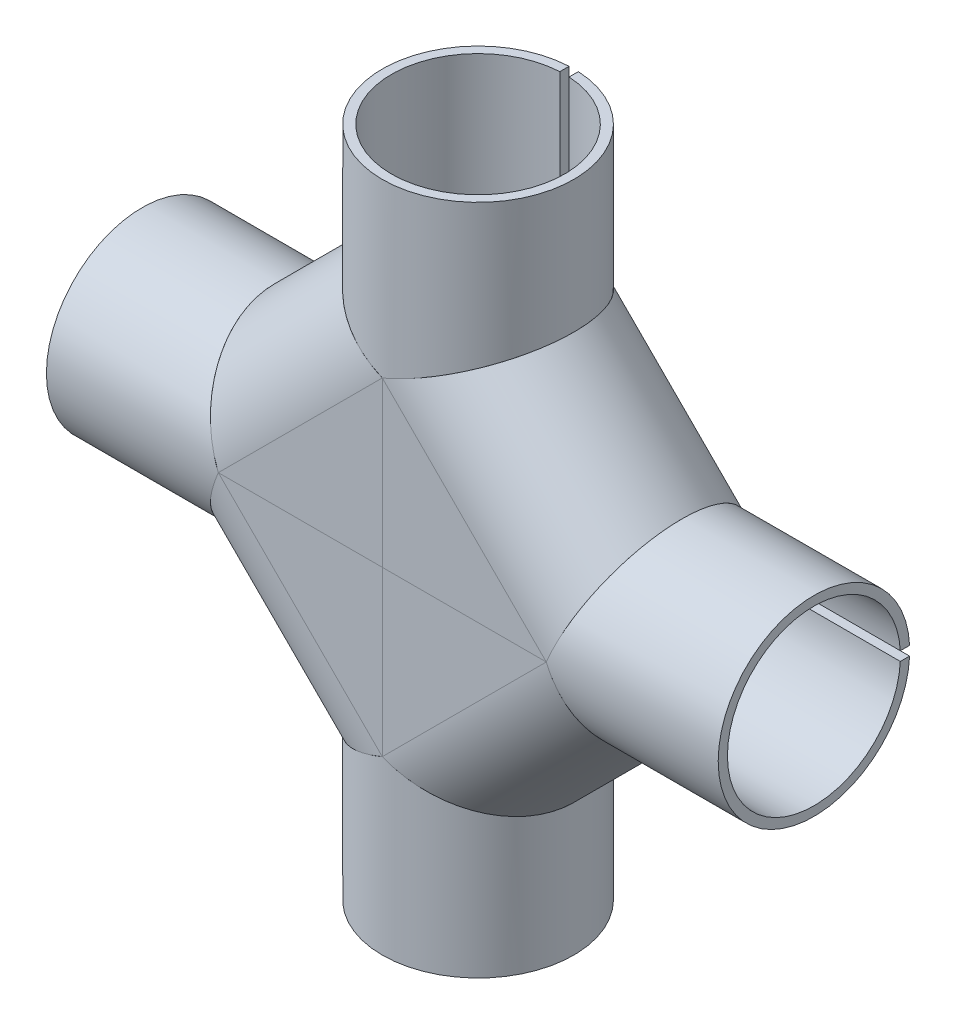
ISO-10303-21;
HEADER;
FILE_DESCRIPTION(('STEP AP214'),'2;1');
FILE_NAME('part.step','',(''),(''),'','','');
FILE_SCHEMA(('AUTOMOTIVE_DESIGN { 1 0 10303 214 1 1 1 1 }'));
ENDSEC;
DATA;
#1=APPLICATION_CONTEXT('core data for automotive mechanical design processes');
#2=APPLICATION_PROTOCOL_DEFINITION('international standard','automotive_design',2000,#1);
#3=PRODUCT_CONTEXT('',#1,'mechanical');
#4=PRODUCT('Part','Part','',(#3));
#5=PRODUCT_RELATED_PRODUCT_CATEGORY('part','',(#4));
#6=PRODUCT_DEFINITION_FORMATION('','',#4);
#7=PRODUCT_DEFINITION_CONTEXT('part definition',#1,'design');
#8=PRODUCT_DEFINITION('design','',#6,#7);
#9=PRODUCT_DEFINITION_SHAPE('','',#8);
#10=(LENGTH_UNIT() NAMED_UNIT(*) SI_UNIT(.MILLI.,.METRE.));
#11=(NAMED_UNIT(*) PLANE_ANGLE_UNIT() SI_UNIT($,.RADIAN.));
#12=(NAMED_UNIT(*) SI_UNIT($,.STERADIAN.) SOLID_ANGLE_UNIT());
#13=UNCERTAINTY_MEASURE_WITH_UNIT(LENGTH_MEASURE(1.E-05),#10,'distance_accuracy_value','');
#14=(GEOMETRIC_REPRESENTATION_CONTEXT(3) GLOBAL_UNCERTAINTY_ASSIGNED_CONTEXT((#13)) GLOBAL_UNIT_ASSIGNED_CONTEXT((#10,
#11,#12)) REPRESENTATION_CONTEXT('',''));
#15=CARTESIAN_POINT('',(0.,0.,0.));
#16=DIRECTION('',(0.,0.,1.));
#17=DIRECTION('',(1.,0.,0.));
#18=AXIS2_PLACEMENT_3D('',#15,#16,#17);
#19=CARTESIAN_POINT('',(-36.3119482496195,3.80347689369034E-13,0.));
#20=DIRECTION('',(1.,0.,0.));
#21=DIRECTION('',(0.,0.,-1.));
#22=AXIS2_PLACEMENT_3D('',#19,#20,#21);
#23=CYLINDRICAL_SURFACE('',#22,10.3513698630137);
#24=CARTESIAN_POINT('',(-17.7282787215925,1.8569397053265E-13,0.));
#25=DIRECTION('',(0.923879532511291,0.382683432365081,0.));
#26=DIRECTION('',(0.382683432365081,-0.923879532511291,0.));
#27=AXIS2_PLACEMENT_3D('',#24,#25,#26);
#28=ELLIPSE('',#27,11.2042420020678,10.3513698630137);
#29=CARTESIAN_POINT('',(-17.9353855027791,0.500000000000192,-10.3392871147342));
#30=VERTEX_POINT('',#29);
#31=CARTESIAN_POINT('',(-17.7282787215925,1.81701733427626E-13,10.3513698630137));
#32=VERTEX_POINT('',#31);
#33=EDGE_CURVE('E115',#30,#32,#28,.T.);
#34=ORIENTED_EDGE('',*,*,#33,.F.);
#35=DIRECTION('',(1.,0.,0.));
#36=VECTOR('',#35,1.);
#37=CARTESIAN_POINT('',(-36.3119482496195,0.500000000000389,-10.3392871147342));
#38=LINE('',#37,#36);
#39=CARTESIAN_POINT('',(-36.3119482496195,0.500000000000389,-10.3392871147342));
#40=VERTEX_POINT('',#39);
#41=EDGE_CURVE('E77',#30,#40,#38,.F.);
#42=ORIENTED_EDGE('',*,*,#41,.T.);
#43=CARTESIAN_POINT('',(-36.3119482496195,3.80347689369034E-13,0.));
#44=DIRECTION('',(-1.,0.,0.));
#45=DIRECTION('',(0.,0.,1.));
#46=AXIS2_PLACEMENT_3D('',#43,#44,#45);
#47=CIRCLE('',#46,10.3513698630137);
#48=CARTESIAN_POINT('',(-36.3119482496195,-0.499999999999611,-10.3392871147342));
#49=VERTEX_POINT('',#48);
#50=EDGE_CURVE('E113',#49,#40,#47,.T.);
#51=ORIENTED_EDGE('',*,*,#50,.F.);
#52=DIRECTION('',(1.,0.,0.));
#53=VECTOR('',#52,1.);
#54=CARTESIAN_POINT('',(-36.3119482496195,-0.499999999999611,-10.3392871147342));
#55=LINE('',#54,#53);
#56=CARTESIAN_POINT('',(-17.9353855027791,-0.499999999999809,-10.3392871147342));
#57=VERTEX_POINT('',#56);
#58=EDGE_CURVE('E141',#57,#49,#55,.F.);
#59=ORIENTED_EDGE('',*,*,#58,.F.);
#60=CARTESIAN_POINT('',(-17.7282787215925,1.8569397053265E-13,0.));
#61=DIRECTION('',(0.923879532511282,-0.382683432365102,0.));
#62=DIRECTION('',(0.382683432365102,0.923879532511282,0.));
#63=AXIS2_PLACEMENT_3D('',#60,#61,#62);
#64=ELLIPSE('',#63,11.2042420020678,10.3513698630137);
#65=EDGE_CURVE('E124',#32,#57,#64,.T.);
#66=ORIENTED_EDGE('',*,*,#65,.F.);
#67=EDGE_LOOP('',(#34,#42,#51,#59,#66));
#68=FACE_BOUND('',#67,.T.);
#69=ADVANCED_FACE('F56',(#68),#23,.T.);
#70=CARTESIAN_POINT('',(-22.0159565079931,-10.3513698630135,-10.3513698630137));
#71=DIRECTION('',(0.923879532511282,-0.382683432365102,0.));
#72=DIRECTION('',(0.382683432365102,0.923879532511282,0.));
#73=AXIS2_PLACEMENT_3D('',#70,#71,#72);
#74=PLANE('',#73);
#75=ORIENTED_EDGE('',*,*,#65,.T.);
#76=DIRECTION('',(0.,0.,1.));
#77=VECTOR('',#76,1.);
#78=CARTESIAN_POINT('',(-17.9353855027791,-0.499999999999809,-10.3513698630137));
#79=LINE('',#78,#77);
#80=CARTESIAN_POINT('',(-17.9353855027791,-0.499999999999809,-9.33799327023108));
#81=VERTEX_POINT('',#80);
#82=EDGE_CURVE('E14',#57,#81,#79,.T.);
#83=ORIENTED_EDGE('',*,*,#82,.T.);
#84=CARTESIAN_POINT('',(-17.7282787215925,1.8569397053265E-13,0.));
#85=DIRECTION('',(0.923879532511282,-0.382683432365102,0.));
#86=DIRECTION('',(0.382683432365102,0.923879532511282,0.));
#87=AXIS2_PLACEMENT_3D('',#84,#85,#86);
#88=ELLIPSE('',#87,10.1218498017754,9.3513698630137);
#89=CARTESIAN_POINT('',(-17.7282787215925,1.81701733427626E-13,9.35136986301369));
#90=VERTEX_POINT('',#89);
#91=EDGE_CURVE('E122',#90,#81,#88,.T.);
#92=ORIENTED_EDGE('',*,*,#91,.F.);
#93=DIRECTION('',(0.,0.,1.));
#94=VECTOR('',#93,1.);
#95=CARTESIAN_POINT('',(-17.7282787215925,1.81701733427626E-13,-10.3513698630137));
#96=LINE('',#95,#94);
#97=EDGE_CURVE('E137',#90,#32,#96,.T.);
#98=ORIENTED_EDGE('',*,*,#97,.T.);
#99=EDGE_LOOP('',(#75,#83,#92,#98));
#100=FACE_BOUND('',#99,.T.);
#101=ADVANCED_FACE('F143',(#100),#74,.T.);
#102=CARTESIAN_POINT('',(-36.3119482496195,3.80347689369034E-13,0.));
#103=DIRECTION('',(1.,0.,0.));
#104=DIRECTION('',(0.,0.,-1.));
#105=AXIS2_PLACEMENT_3D('',#102,#103,#104);
#106=CYLINDRICAL_SURFACE('',#105,9.3513698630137);
#107=DIRECTION('',(1.,0.,0.));
#108=VECTOR('',#107,1.);
#109=CARTESIAN_POINT('',(-36.3119482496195,0.500000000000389,-9.33799327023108));
#110=LINE('',#109,#108);
#111=CARTESIAN_POINT('',(-17.9353855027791,0.500000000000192,-9.33799327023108));
#112=VERTEX_POINT('',#111);
#113=CARTESIAN_POINT('',(-36.3119482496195,0.500000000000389,-9.33799327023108));
#114=VERTEX_POINT('',#113);
#115=EDGE_CURVE('E102',#112,#114,#110,.F.);
#116=ORIENTED_EDGE('',*,*,#115,.F.);
#117=CARTESIAN_POINT('',(-17.7282787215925,1.8569397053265E-13,0.));
#118=DIRECTION('',(0.923879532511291,0.382683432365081,0.));
#119=DIRECTION('',(0.382683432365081,-0.923879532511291,0.));
#120=AXIS2_PLACEMENT_3D('',#117,#118,#119);
#121=ELLIPSE('',#120,10.1218498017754,9.3513698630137);
#122=EDGE_CURVE('E119',#112,#90,#121,.T.);
#123=ORIENTED_EDGE('',*,*,#122,.T.);
#124=ORIENTED_EDGE('',*,*,#91,.T.);
#125=DIRECTION('',(1.,0.,0.));
#126=VECTOR('',#125,1.);
#127=CARTESIAN_POINT('',(-36.3119482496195,-0.499999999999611,-9.33799327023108));
#128=LINE('',#127,#126);
#129=CARTESIAN_POINT('',(-36.3119482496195,-0.499999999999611,-9.33799327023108));
#130=VERTEX_POINT('',#129);
#131=EDGE_CURVE('E70',#81,#130,#128,.F.);
#132=ORIENTED_EDGE('',*,*,#131,.T.);
#133=CARTESIAN_POINT('',(-36.3119482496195,3.80347689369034E-13,0.));
#134=DIRECTION('',(-1.,0.,0.));
#135=DIRECTION('',(0.,1.,0.));
#136=AXIS2_PLACEMENT_3D('',#133,#134,#135);
#137=CIRCLE('',#136,9.3513698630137);
#138=EDGE_CURVE('E120',#130,#114,#137,.T.);
#139=ORIENTED_EDGE('',*,*,#138,.T.);
#140=EDGE_LOOP('',(#116,#123,#124,#132,#139));
#141=FACE_BOUND('',#140,.T.);
#142=ADVANCED_FACE('F132',(#141),#106,.F.);
#143=CARTESIAN_POINT('',(-36.3119482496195,3.80347689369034E-13,0.));
#144=DIRECTION('',(-1.,0.,0.));
#145=DIRECTION('',(0.,0.,1.));
#146=AXIS2_PLACEMENT_3D('',#143,#144,#145);
#147=PLANE('',#146);
#148=DIRECTION('',(0.,0.,1.));
#149=VECTOR('',#148,1.);
#150=CARTESIAN_POINT('',(-36.3119482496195,0.500000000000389,-10.3513698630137));
#151=LINE('',#150,#149);
#152=EDGE_CURVE('E99',#40,#114,#151,.T.);
#153=ORIENTED_EDGE('',*,*,#152,.T.);
#154=ORIENTED_EDGE('',*,*,#138,.F.);
#155=DIRECTION('',(0.,0.,1.));
#156=VECTOR('',#155,1.);
#157=CARTESIAN_POINT('',(-36.3119482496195,-0.499999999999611,-10.3513698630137));
#158=LINE('',#157,#156);
#159=EDGE_CURVE('E107',#49,#130,#158,.T.);
#160=ORIENTED_EDGE('',*,*,#159,.F.);
#161=ORIENTED_EDGE('',*,*,#50,.T.);
#162=EDGE_LOOP('',(#153,#154,#160,#161));
#163=FACE_BOUND('',#162,.T.);
#164=ADVANCED_FACE('F118',(#163),#147,.T.);
#165=CARTESIAN_POINT('',(-17.7282787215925,1.81701733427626E-13,-10.3513698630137));
#166=DIRECTION('',(0.923879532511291,0.382683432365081,0.));
#167=DIRECTION('',(-0.382683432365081,0.923879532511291,0.));
#168=AXIS2_PLACEMENT_3D('',#165,#166,#167);
#169=PLANE('',#168);
#170=DIRECTION('',(0.,0.,1.));
#171=VECTOR('',#170,1.);
#172=CARTESIAN_POINT('',(-17.9353855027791,0.500000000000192,-10.3513698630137));
#173=LINE('',#172,#171);
#174=EDGE_CURVE('E63',#30,#112,#173,.T.);
#175=ORIENTED_EDGE('',*,*,#174,.F.);
#176=ORIENTED_EDGE('',*,*,#33,.T.);
#177=ORIENTED_EDGE('',*,*,#97,.F.);
#178=ORIENTED_EDGE('',*,*,#122,.F.);
#179=EDGE_LOOP('',(#175,#176,#177,#178));
#180=FACE_BOUND('',#179,.T.);
#181=ADVANCED_FACE('F135',(#180),#169,.T.);
#182=CARTESIAN_POINT('',(0.,0.5,-10.3513698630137));
#183=DIRECTION('',(0.,1.,0.));
#184=DIRECTION('',(-1.,0.,0.));
#185=AXIS2_PLACEMENT_3D('',#182,#183,#184);
#186=PLANE('',#185);
#187=ORIENTED_EDGE('',*,*,#174,.T.);
#188=ORIENTED_EDGE('',*,*,#115,.T.);
#189=ORIENTED_EDGE('',*,*,#152,.F.);
#190=ORIENTED_EDGE('',*,*,#41,.F.);
#191=EDGE_LOOP('',(#187,#188,#189,#190));
#192=FACE_BOUND('',#191,.T.);
#193=ADVANCED_FACE('F100',(#192),#186,.F.);
#194=CARTESIAN_POINT('',(0.,-0.5,-10.3513698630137));
#195=DIRECTION('',(0.,1.,0.));
#196=DIRECTION('',(-1.,0.,0.));
#197=AXIS2_PLACEMENT_3D('',#194,#195,#196);
#198=PLANE('',#197);
#199=ORIENTED_EDGE('',*,*,#58,.T.);
#200=ORIENTED_EDGE('',*,*,#159,.T.);
#201=ORIENTED_EDGE('',*,*,#131,.F.);
#202=ORIENTED_EDGE('',*,*,#82,.F.);
#203=EDGE_LOOP('',(#199,#200,#201,#202));
#204=FACE_BOUND('',#203,.T.);
#205=ADVANCED_FACE('F147',(#204),#198,.T.);
#206=CLOSED_SHELL('',(#69,#101,#142,#164,#181,#193,#205));
#207=MANIFOLD_SOLID_BREP('B2',#206);
#208=CARTESIAN_POINT('',(0.,-36.3119482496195,0.));
#209=DIRECTION('',(0.,1.,0.));
#210=DIRECTION('',(0.,0.,-1.));
#211=AXIS2_PLACEMENT_3D('',#208,#209,#210);
#212=CYLINDRICAL_SURFACE('',#211,10.3513698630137);
#213=CARTESIAN_POINT('',(0.,-17.7282787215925,0.));
#214=DIRECTION('',(-0.38268343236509,0.923879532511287,0.));
#215=DIRECTION('',(0.923879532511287,0.38268343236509,0.));
#216=AXIS2_PLACEMENT_3D('',#213,#214,#215);
#217=ELLIPSE('',#216,11.2042420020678,10.3513698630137);
#218=CARTESIAN_POINT('',(-0.500000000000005,-17.9353855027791,-10.3392871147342));
#219=VERTEX_POINT('',#218);
#220=CARTESIAN_POINT('',(0.,-17.7282787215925,10.3513698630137));
#221=VERTEX_POINT('',#220);
#222=EDGE_CURVE('E275',#219,#221,#217,.T.);
#223=ORIENTED_EDGE('',*,*,#222,.F.);
#224=DIRECTION('',(0.,1.,0.));
#225=VECTOR('',#224,1.);
#226=CARTESIAN_POINT('',(-0.500000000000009,-36.3119482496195,-10.3392871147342));
#227=LINE('',#226,#225);
#228=CARTESIAN_POINT('',(-0.500000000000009,-36.3119482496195,-10.3392871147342));
#229=VERTEX_POINT('',#228);
#230=EDGE_CURVE('E237',#219,#229,#227,.F.);
#231=ORIENTED_EDGE('',*,*,#230,.T.);
#232=CARTESIAN_POINT('',(0.,-36.3119482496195,0.));
#233=DIRECTION('',(0.,-1.,0.));
#234=DIRECTION('',(0.,0.,1.));
#235=AXIS2_PLACEMENT_3D('',#232,#233,#234);
#236=CIRCLE('',#235,10.3513698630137);
#237=CARTESIAN_POINT('',(0.499999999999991,-36.3119482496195,-10.3392871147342));
#238=VERTEX_POINT('',#237);
#239=EDGE_CURVE('E273',#238,#229,#236,.T.);
#240=ORIENTED_EDGE('',*,*,#239,.F.);
#241=DIRECTION('',(0.,1.,0.));
#242=VECTOR('',#241,1.);
#243=CARTESIAN_POINT('',(0.499999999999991,-36.3119482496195,-10.3392871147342));
#244=LINE('',#243,#242);
#245=CARTESIAN_POINT('',(0.499999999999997,-17.9353855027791,-10.3392871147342));
#246=VERTEX_POINT('',#245);
#247=EDGE_CURVE('E301',#246,#238,#244,.F.);
#248=ORIENTED_EDGE('',*,*,#247,.F.);
#249=CARTESIAN_POINT('',(0.,-17.7282787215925,0.));
#250=DIRECTION('',(0.382683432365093,0.923879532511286,0.));
#251=DIRECTION('',(-0.923879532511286,0.382683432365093,0.));
#252=AXIS2_PLACEMENT_3D('',#249,#250,#251);
#253=ELLIPSE('',#252,11.2042420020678,10.3513698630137);
#254=EDGE_CURVE('E284',#221,#246,#253,.T.);
#255=ORIENTED_EDGE('',*,*,#254,.F.);
#256=EDGE_LOOP('',(#223,#231,#240,#248,#255));
#257=FACE_BOUND('',#256,.T.);
#258=ADVANCED_FACE('F216',(#257),#212,.T.);
#259=CARTESIAN_POINT('',(10.3513698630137,-22.015956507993,-10.3513698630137));
#260=DIRECTION('',(0.382683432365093,0.923879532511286,0.));
#261=DIRECTION('',(-0.923879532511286,0.382683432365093,0.));
#262=AXIS2_PLACEMENT_3D('',#259,#260,#261);
#263=PLANE('',#262);
#264=ORIENTED_EDGE('',*,*,#254,.T.);
#265=DIRECTION('',(0.,0.,1.));
#266=VECTOR('',#265,1.);
#267=CARTESIAN_POINT('',(0.499999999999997,-17.9353855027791,-10.3513698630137));
#268=LINE('',#267,#266);
#269=CARTESIAN_POINT('',(0.499999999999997,-17.9353855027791,-9.33799327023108));
#270=VERTEX_POINT('',#269);
#271=EDGE_CURVE('E54',#246,#270,#268,.T.);
#272=ORIENTED_EDGE('',*,*,#271,.T.);
#273=CARTESIAN_POINT('',(0.,-17.7282787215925,0.));
#274=DIRECTION('',(0.382683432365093,0.923879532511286,0.));
#275=DIRECTION('',(-0.923879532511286,0.382683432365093,0.));
#276=AXIS2_PLACEMENT_3D('',#273,#274,#275);
#277=ELLIPSE('',#276,10.1218498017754,9.3513698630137);
#278=CARTESIAN_POINT('',(0.,-17.7282787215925,9.35136986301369));
#279=VERTEX_POINT('',#278);
#280=EDGE_CURVE('E282',#279,#270,#277,.T.);
#281=ORIENTED_EDGE('',*,*,#280,.F.);
#282=DIRECTION('',(0.,0.,1.));
#283=VECTOR('',#282,1.);
#284=CARTESIAN_POINT('',(0.,-17.7282787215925,-10.3513698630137));
#285=LINE('',#284,#283);
#286=EDGE_CURVE('E297',#279,#221,#285,.T.);
#287=ORIENTED_EDGE('',*,*,#286,.T.);
#288=EDGE_LOOP('',(#264,#272,#281,#287));
#289=FACE_BOUND('',#288,.T.);
#290=ADVANCED_FACE('F303',(#289),#263,.T.);
#291=CARTESIAN_POINT('',(0.,-36.3119482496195,0.));
#292=DIRECTION('',(0.,1.,0.));
#293=DIRECTION('',(0.,0.,-1.));
#294=AXIS2_PLACEMENT_3D('',#291,#292,#293);
#295=CYLINDRICAL_SURFACE('',#294,9.3513698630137);
#296=DIRECTION('',(0.,1.,0.));
#297=VECTOR('',#296,1.);
#298=CARTESIAN_POINT('',(-0.500000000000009,-36.3119482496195,-9.33799327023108));
#299=LINE('',#298,#297);
#300=CARTESIAN_POINT('',(-0.500000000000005,-17.9353855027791,-9.33799327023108));
#301=VERTEX_POINT('',#300);
#302=CARTESIAN_POINT('',(-0.500000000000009,-36.3119482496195,-9.33799327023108));
#303=VERTEX_POINT('',#302);
#304=EDGE_CURVE('E262',#301,#303,#299,.F.);
#305=ORIENTED_EDGE('',*,*,#304,.F.);
#306=CARTESIAN_POINT('',(0.,-17.7282787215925,0.));
#307=DIRECTION('',(-0.38268343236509,0.923879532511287,0.));
#308=DIRECTION('',(0.923879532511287,0.38268343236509,0.));
#309=AXIS2_PLACEMENT_3D('',#306,#307,#308);
#310=ELLIPSE('',#309,10.1218498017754,9.3513698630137);
#311=EDGE_CURVE('E279',#301,#279,#310,.T.);
#312=ORIENTED_EDGE('',*,*,#311,.T.);
#313=ORIENTED_EDGE('',*,*,#280,.T.);
#314=DIRECTION('',(0.,1.,0.));
#315=VECTOR('',#314,1.);
#316=CARTESIAN_POINT('',(0.499999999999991,-36.3119482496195,-9.33799327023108));
#317=LINE('',#316,#315);
#318=CARTESIAN_POINT('',(0.499999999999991,-36.3119482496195,-9.33799327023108));
#319=VERTEX_POINT('',#318);
#320=EDGE_CURVE('E230',#270,#319,#317,.F.);
#321=ORIENTED_EDGE('',*,*,#320,.T.);
#322=CARTESIAN_POINT('',(0.,-36.3119482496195,0.));
#323=DIRECTION('',(0.,-1.,0.));
#324=DIRECTION('',(-1.,0.,0.));
#325=AXIS2_PLACEMENT_3D('',#322,#323,#324);
#326=CIRCLE('',#325,9.3513698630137);
#327=EDGE_CURVE('E280',#319,#303,#326,.T.);
#328=ORIENTED_EDGE('',*,*,#327,.T.);
#329=EDGE_LOOP('',(#305,#312,#313,#321,#328));
#330=FACE_BOUND('',#329,.T.);
#331=ADVANCED_FACE('F292',(#330),#295,.F.);
#332=CARTESIAN_POINT('',(0.,-36.3119482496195,0.));
#333=DIRECTION('',(0.,-1.,0.));
#334=DIRECTION('',(0.,0.,1.));
#335=AXIS2_PLACEMENT_3D('',#332,#333,#334);
#336=PLANE('',#335);
#337=DIRECTION('',(0.,0.,1.));
#338=VECTOR('',#337,1.);
#339=CARTESIAN_POINT('',(-0.500000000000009,-36.3119482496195,-10.3513698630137));
#340=LINE('',#339,#338);
#341=EDGE_CURVE('E259',#229,#303,#340,.T.);
#342=ORIENTED_EDGE('',*,*,#341,.T.);
#343=ORIENTED_EDGE('',*,*,#327,.F.);
#344=DIRECTION('',(0.,0.,1.));
#345=VECTOR('',#344,1.);
#346=CARTESIAN_POINT('',(0.499999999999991,-36.3119482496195,-10.3513698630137));
#347=LINE('',#346,#345);
#348=EDGE_CURVE('E267',#238,#319,#347,.T.);
#349=ORIENTED_EDGE('',*,*,#348,.F.);
#350=ORIENTED_EDGE('',*,*,#239,.T.);
#351=EDGE_LOOP('',(#342,#343,#349,#350));
#352=FACE_BOUND('',#351,.T.);
#353=ADVANCED_FACE('F278',(#352),#336,.T.);
#354=CARTESIAN_POINT('',(0.,-17.7282787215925,-10.3513698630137));
#355=DIRECTION('',(-0.38268343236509,0.923879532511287,0.));
#356=DIRECTION('',(-0.923879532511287,-0.38268343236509,0.));
#357=AXIS2_PLACEMENT_3D('',#354,#355,#356);
#358=PLANE('',#357);
#359=DIRECTION('',(0.,0.,1.));
#360=VECTOR('',#359,1.);
#361=CARTESIAN_POINT('',(-0.500000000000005,-17.9353855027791,-10.3513698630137));
#362=LINE('',#361,#360);
#363=EDGE_CURVE('E223',#219,#301,#362,.T.);
#364=ORIENTED_EDGE('',*,*,#363,.F.);
#365=ORIENTED_EDGE('',*,*,#222,.T.);
#366=ORIENTED_EDGE('',*,*,#286,.F.);
#367=ORIENTED_EDGE('',*,*,#311,.F.);
#368=EDGE_LOOP('',(#364,#365,#366,#367));
#369=FACE_BOUND('',#368,.T.);
#370=ADVANCED_FACE('F295',(#369),#358,.T.);
#371=CARTESIAN_POINT('',(-0.5,0.,-10.3513698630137));
#372=DIRECTION('',(-1.,0.,0.));
#373=DIRECTION('',(0.,-1.,0.));
#374=AXIS2_PLACEMENT_3D('',#371,#372,#373);
#375=PLANE('',#374);
#376=ORIENTED_EDGE('',*,*,#363,.T.);
#377=ORIENTED_EDGE('',*,*,#304,.T.);
#378=ORIENTED_EDGE('',*,*,#341,.F.);
#379=ORIENTED_EDGE('',*,*,#230,.F.);
#380=EDGE_LOOP('',(#376,#377,#378,#379));
#381=FACE_BOUND('',#380,.T.);
#382=ADVANCED_FACE('F260',(#381),#375,.F.);
#383=CARTESIAN_POINT('',(0.5,0.,-10.3513698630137));
#384=DIRECTION('',(-1.,0.,0.));
#385=DIRECTION('',(0.,-1.,0.));
#386=AXIS2_PLACEMENT_3D('',#383,#384,#385);
#387=PLANE('',#386);
#388=ORIENTED_EDGE('',*,*,#247,.T.);
#389=ORIENTED_EDGE('',*,*,#348,.T.);
#390=ORIENTED_EDGE('',*,*,#320,.F.);
#391=ORIENTED_EDGE('',*,*,#271,.F.);
#392=EDGE_LOOP('',(#388,#389,#390,#391));
#393=FACE_BOUND('',#392,.T.);
#394=ADVANCED_FACE('F307',(#393),#387,.T.);
#395=CLOSED_SHELL('',(#258,#290,#331,#353,#370,#382,#394));
#396=MANIFOLD_SOLID_BREP('B8',#395);
#397=CARTESIAN_POINT('',(36.3119482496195,-1.26782563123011E-13,0.));
#398=DIRECTION('',(-1.,0.,0.));
#399=DIRECTION('',(0.,0.,-1.));
#400=AXIS2_PLACEMENT_3D('',#397,#398,#399);
#401=CYLINDRICAL_SURFACE('',#400,10.3513698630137);
#402=CARTESIAN_POINT('',(17.7282787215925,0.,0.));
#403=DIRECTION('',(-0.923879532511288,-0.382683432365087,0.));
#404=DIRECTION('',(-0.382683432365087,0.923879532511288,0.));
#405=AXIS2_PLACEMENT_3D('',#402,#403,#404);
#406=ELLIPSE('',#405,11.2042420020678,10.3513698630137);
#407=CARTESIAN_POINT('',(17.9353855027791,-0.500000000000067,-10.3392871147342));
#408=VERTEX_POINT('',#407);
#409=CARTESIAN_POINT('',(17.7282787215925,0.,10.3513698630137));
#410=VERTEX_POINT('',#409);
#411=EDGE_CURVE('E435',#408,#410,#406,.T.);
#412=ORIENTED_EDGE('',*,*,#411,.F.);
#413=DIRECTION('',(-1.,0.,0.));
#414=VECTOR('',#413,1.);
#415=CARTESIAN_POINT('',(36.3119482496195,-0.500000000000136,-10.3392871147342));
#416=LINE('',#415,#414);
#417=CARTESIAN_POINT('',(36.3119482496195,-0.500000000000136,-10.3392871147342));
#418=VERTEX_POINT('',#417);
#419=EDGE_CURVE('E397',#408,#418,#416,.F.);
#420=ORIENTED_EDGE('',*,*,#419,.T.);
#421=CARTESIAN_POINT('',(36.3119482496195,-1.26782563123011E-13,0.));
#422=DIRECTION('',(1.,0.,0.));
#423=DIRECTION('',(0.,0.,1.));
#424=AXIS2_PLACEMENT_3D('',#421,#422,#423);
#425=CIRCLE('',#424,10.3513698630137);
#426=CARTESIAN_POINT('',(36.3119482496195,0.499999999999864,-10.3392871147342));
#427=VERTEX_POINT('',#426);
#428=EDGE_CURVE('E433',#427,#418,#425,.T.);
#429=ORIENTED_EDGE('',*,*,#428,.F.);
#430=DIRECTION('',(-1.,0.,0.));
#431=VECTOR('',#430,1.);
#432=CARTESIAN_POINT('',(36.3119482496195,0.499999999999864,-10.3392871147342));
#433=LINE('',#432,#431);
#434=CARTESIAN_POINT('',(17.9353855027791,0.499999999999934,-10.3392871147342));
#435=VERTEX_POINT('',#434);
#436=EDGE_CURVE('E461',#435,#427,#433,.F.);
#437=ORIENTED_EDGE('',*,*,#436,.F.);
#438=CARTESIAN_POINT('',(17.7282787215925,0.,0.));
#439=DIRECTION('',(-0.923879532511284,0.382683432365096,0.));
#440=DIRECTION('',(-0.382683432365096,-0.923879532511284,0.));
#441=AXIS2_PLACEMENT_3D('',#438,#439,#440);
#442=ELLIPSE('',#441,11.2042420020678,10.3513698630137);
#443=EDGE_CURVE('E444',#410,#435,#442,.T.);
#444=ORIENTED_EDGE('',*,*,#443,.F.);
#445=EDGE_LOOP('',(#412,#420,#429,#437,#444));
#446=FACE_BOUND('',#445,.T.);
#447=ADVANCED_FACE('F376',(#446),#401,.T.);
#448=CARTESIAN_POINT('',(22.015956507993,10.3513698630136,-10.3513698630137));
#449=DIRECTION('',(-0.923879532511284,0.382683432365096,0.));
#450=DIRECTION('',(-0.382683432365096,-0.923879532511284,0.));
#451=AXIS2_PLACEMENT_3D('',#448,#449,#450);
#452=PLANE('',#451);
#453=ORIENTED_EDGE('',*,*,#443,.T.);
#454=DIRECTION('',(0.,0.,1.));
#455=VECTOR('',#454,1.);
#456=CARTESIAN_POINT('',(17.9353855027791,0.499999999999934,-10.3513698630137));
#457=LINE('',#456,#455);
#458=CARTESIAN_POINT('',(17.9353855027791,0.499999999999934,-9.33799327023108));
#459=VERTEX_POINT('',#458);
#460=EDGE_CURVE('E214',#435,#459,#457,.T.);
#461=ORIENTED_EDGE('',*,*,#460,.T.);
#462=CARTESIAN_POINT('',(17.7282787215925,0.,0.));
#463=DIRECTION('',(-0.923879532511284,0.382683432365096,0.));
#464=DIRECTION('',(-0.382683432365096,-0.923879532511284,0.));
#465=AXIS2_PLACEMENT_3D('',#462,#463,#464);
#466=ELLIPSE('',#465,10.1218498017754,9.3513698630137);
#467=CARTESIAN_POINT('',(17.7282787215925,0.,9.35136986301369));
#468=VERTEX_POINT('',#467);
#469=EDGE_CURVE('E442',#468,#459,#466,.T.);
#470=ORIENTED_EDGE('',*,*,#469,.F.);
#471=DIRECTION('',(0.,0.,1.));
#472=VECTOR('',#471,1.);
#473=CARTESIAN_POINT('',(17.7282787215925,0.,-10.3513698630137));
#474=LINE('',#473,#472);
#475=EDGE_CURVE('E457',#468,#410,#474,.T.);
#476=ORIENTED_EDGE('',*,*,#475,.T.);
#477=EDGE_LOOP('',(#453,#461,#470,#476));
#478=FACE_BOUND('',#477,.T.);
#479=ADVANCED_FACE('F463',(#478),#452,.T.);
#480=CARTESIAN_POINT('',(36.3119482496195,-1.26782563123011E-13,0.));
#481=DIRECTION('',(-1.,0.,0.));
#482=DIRECTION('',(0.,0.,-1.));
#483=AXIS2_PLACEMENT_3D('',#480,#481,#482);
#484=CYLINDRICAL_SURFACE('',#483,9.3513698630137);
#485=DIRECTION('',(-1.,0.,0.));
#486=VECTOR('',#485,1.);
#487=CARTESIAN_POINT('',(36.3119482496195,-0.500000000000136,-9.33799327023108));
#488=LINE('',#487,#486);
#489=CARTESIAN_POINT('',(17.9353855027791,-0.500000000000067,-9.33799327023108));
#490=VERTEX_POINT('',#489);
#491=CARTESIAN_POINT('',(36.3119482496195,-0.500000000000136,-9.33799327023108));
#492=VERTEX_POINT('',#491);
#493=EDGE_CURVE('E422',#490,#492,#488,.F.);
#494=ORIENTED_EDGE('',*,*,#493,.F.);
#495=CARTESIAN_POINT('',(17.7282787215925,0.,0.));
#496=DIRECTION('',(-0.923879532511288,-0.382683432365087,0.));
#497=DIRECTION('',(-0.382683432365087,0.923879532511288,0.));
#498=AXIS2_PLACEMENT_3D('',#495,#496,#497);
#499=ELLIPSE('',#498,10.1218498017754,9.3513698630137);
#500=EDGE_CURVE('E439',#490,#468,#499,.T.);
#501=ORIENTED_EDGE('',*,*,#500,.T.);
#502=ORIENTED_EDGE('',*,*,#469,.T.);
#503=DIRECTION('',(-1.,0.,0.));
#504=VECTOR('',#503,1.);
#505=CARTESIAN_POINT('',(36.3119482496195,0.499999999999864,-9.33799327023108));
#506=LINE('',#505,#504);
#507=CARTESIAN_POINT('',(36.3119482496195,0.499999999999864,-9.33799327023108));
#508=VERTEX_POINT('',#507);
#509=EDGE_CURVE('E390',#459,#508,#506,.F.);
#510=ORIENTED_EDGE('',*,*,#509,.T.);
#511=CARTESIAN_POINT('',(36.3119482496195,-1.26782563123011E-13,0.));
#512=DIRECTION('',(1.,0.,0.));
#513=DIRECTION('',(0.,-1.,0.));
#514=AXIS2_PLACEMENT_3D('',#511,#512,#513);
#515=CIRCLE('',#514,9.3513698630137);
#516=EDGE_CURVE('E440',#508,#492,#515,.T.);
#517=ORIENTED_EDGE('',*,*,#516,.T.);
#518=EDGE_LOOP('',(#494,#501,#502,#510,#517));
#519=FACE_BOUND('',#518,.T.);
#520=ADVANCED_FACE('F452',(#519),#484,.F.);
#521=CARTESIAN_POINT('',(36.3119482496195,-1.26782563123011E-13,0.));
#522=DIRECTION('',(1.,0.,0.));
#523=DIRECTION('',(0.,0.,1.));
#524=AXIS2_PLACEMENT_3D('',#521,#522,#523);
#525=PLANE('',#524);
#526=DIRECTION('',(0.,0.,1.));
#527=VECTOR('',#526,1.);
#528=CARTESIAN_POINT('',(36.3119482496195,-0.500000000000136,-10.3513698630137));
#529=LINE('',#528,#527);
#530=EDGE_CURVE('E419',#418,#492,#529,.T.);
#531=ORIENTED_EDGE('',*,*,#530,.T.);
#532=ORIENTED_EDGE('',*,*,#516,.F.);
#533=DIRECTION('',(0.,0.,1.));
#534=VECTOR('',#533,1.);
#535=CARTESIAN_POINT('',(36.3119482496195,0.499999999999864,-10.3513698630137));
#536=LINE('',#535,#534);
#537=EDGE_CURVE('E427',#427,#508,#536,.T.);
#538=ORIENTED_EDGE('',*,*,#537,.F.);
#539=ORIENTED_EDGE('',*,*,#428,.T.);
#540=EDGE_LOOP('',(#531,#532,#538,#539));
#541=FACE_BOUND('',#540,.T.);
#542=ADVANCED_FACE('F438',(#541),#525,.T.);
#543=CARTESIAN_POINT('',(17.7282787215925,0.,-10.3513698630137));
#544=DIRECTION('',(-0.923879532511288,-0.382683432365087,0.));
#545=DIRECTION('',(0.382683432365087,-0.923879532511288,0.));
#546=AXIS2_PLACEMENT_3D('',#543,#544,#545);
#547=PLANE('',#546);
#548=DIRECTION('',(0.,0.,1.));
#549=VECTOR('',#548,1.);
#550=CARTESIAN_POINT('',(17.9353855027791,-0.500000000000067,-10.3513698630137));
#551=LINE('',#550,#549);
#552=EDGE_CURVE('E383',#408,#490,#551,.T.);
#553=ORIENTED_EDGE('',*,*,#552,.F.);
#554=ORIENTED_EDGE('',*,*,#411,.T.);
#555=ORIENTED_EDGE('',*,*,#475,.F.);
#556=ORIENTED_EDGE('',*,*,#500,.F.);
#557=EDGE_LOOP('',(#553,#554,#555,#556));
#558=FACE_BOUND('',#557,.T.);
#559=ADVANCED_FACE('F455',(#558),#547,.T.);
#560=CARTESIAN_POINT('',(0.,-0.5,-10.3513698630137));
#561=DIRECTION('',(0.,-1.,0.));
#562=DIRECTION('',(1.,0.,0.));
#563=AXIS2_PLACEMENT_3D('',#560,#561,#562);
#564=PLANE('',#563);
#565=ORIENTED_EDGE('',*,*,#552,.T.);
#566=ORIENTED_EDGE('',*,*,#493,.T.);
#567=ORIENTED_EDGE('',*,*,#530,.F.);
#568=ORIENTED_EDGE('',*,*,#419,.F.);
#569=EDGE_LOOP('',(#565,#566,#567,#568));
#570=FACE_BOUND('',#569,.T.);
#571=ADVANCED_FACE('F420',(#570),#564,.F.);
#572=CARTESIAN_POINT('',(0.,0.5,-10.3513698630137));
#573=DIRECTION('',(0.,-1.,0.));
#574=DIRECTION('',(1.,0.,0.));
#575=AXIS2_PLACEMENT_3D('',#572,#573,#574);
#576=PLANE('',#575);
#577=ORIENTED_EDGE('',*,*,#436,.T.);
#578=ORIENTED_EDGE('',*,*,#537,.T.);
#579=ORIENTED_EDGE('',*,*,#509,.F.);
#580=ORIENTED_EDGE('',*,*,#460,.F.);
#581=EDGE_LOOP('',(#577,#578,#579,#580));
#582=FACE_BOUND('',#581,.T.);
#583=ADVANCED_FACE('F467',(#582),#576,.T.);
#584=CLOSED_SHELL('',(#447,#479,#520,#542,#559,#571,#583));
#585=MANIFOLD_SOLID_BREP('B48',#584);
#586=CARTESIAN_POINT('',(1.89163417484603E-13,17.7282787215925,0.));
#587=DIRECTION('',(-0.707106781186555,-0.70710678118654,0.));
#588=DIRECTION('',(0.70710678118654,-0.707106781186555,0.));
#589=AXIS2_PLACEMENT_3D('',#586,#587,#588);
#590=CYLINDRICAL_SURFACE('',#589,9.35136986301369);
#591=CARTESIAN_POINT('',(1.8569397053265E-13,17.7282787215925,0.));
#592=DIRECTION('',(0.382683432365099,0.923879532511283,0.));
#593=DIRECTION('',(-0.923879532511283,0.382683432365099,0.));
#594=AXIS2_PLACEMENT_3D('',#591,#592,#593);
#595=ELLIPSE('',#594,10.1218498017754,9.35136986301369);
#596=CARTESIAN_POINT('',(1.89776734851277E-13,17.7282787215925,-9.35136986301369));
#597=VERTEX_POINT('',#596);
#598=CARTESIAN_POINT('',(1.8569397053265E-13,17.7282787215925,9.3513698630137));
#599=VERTEX_POINT('',#598);
#600=EDGE_CURVE('E559',#597,#599,#595,.T.);
#601=ORIENTED_EDGE('',*,*,#600,.T.);
#602=DIRECTION('',(-0.707106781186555,-0.70710678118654,0.));
#603=VECTOR('',#602,1.);
#604=CARTESIAN_POINT('',(1.9039005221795E-13,17.7282787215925,9.35136986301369));
#605=LINE('',#604,#603);
#606=CARTESIAN_POINT('',(-17.7282787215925,1.81701733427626E-13,9.3513698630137));
#607=VERTEX_POINT('',#606);
#608=EDGE_CURVE('E374',#599,#607,#605,.T.);
#609=ORIENTED_EDGE('',*,*,#608,.T.);
#610=CARTESIAN_POINT('',(-17.7282787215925,1.78755076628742E-13,0.));
#611=DIRECTION('',(-0.923879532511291,-0.382683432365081,0.));
#612=DIRECTION('',(0.382683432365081,-0.923879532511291,0.));
#613=AXIS2_PLACEMENT_3D('',#610,#611,#612);
#614=ELLIPSE('',#613,10.1218498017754,9.35136986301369);
#615=CARTESIAN_POINT('',(-17.7282787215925,1.81701733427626E-13,-9.35136986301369));
#616=VERTEX_POINT('',#615);
#617=EDGE_CURVE('E544',#607,#616,#614,.T.);
#618=ORIENTED_EDGE('',*,*,#617,.T.);
#619=DIRECTION('',(-0.707106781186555,-0.70710678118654,0.));
#620=VECTOR('',#619,1.);
#621=CARTESIAN_POINT('',(1.9039005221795E-13,17.7282787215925,-9.35136986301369));
#622=LINE('',#621,#620);
#623=EDGE_CURVE('E599',#616,#597,#622,.F.);
#624=ORIENTED_EDGE('',*,*,#623,.T.);
#625=EDGE_LOOP('',(#601,#609,#618,#624));
#626=FACE_BOUND('',#625,.T.);
#627=ADVANCED_FACE('F536',(#626),#590,.F.);
#628=CARTESIAN_POINT('',(-17.7282787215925,1.81701733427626E-13,-10.3513698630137));
#629=DIRECTION('',(-0.923879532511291,-0.382683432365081,0.));
#630=DIRECTION('',(0.382683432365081,-0.923879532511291,0.));
#631=AXIS2_PLACEMENT_3D('',#628,#629,#630);
#632=PLANE('',#631);
#633=CARTESIAN_POINT('',(-17.7282787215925,1.78755076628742E-13,0.));
#634=DIRECTION('',(-0.923879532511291,-0.382683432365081,0.));
#635=DIRECTION('',(0.382683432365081,-0.923879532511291,0.));
#636=AXIS2_PLACEMENT_3D('',#633,#634,#635);
#637=ELLIPSE('',#636,11.2042420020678,10.3513698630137);
#638=CARTESIAN_POINT('',(-17.7282787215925,1.81701733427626E-13,10.3513698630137));
#639=VERTEX_POINT('',#638);
#640=CARTESIAN_POINT('',(-17.7282787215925,1.81701733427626E-13,-10.3513698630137));
#641=VERTEX_POINT('',#640);
#642=EDGE_CURVE('E644',#639,#641,#637,.T.);
#643=ORIENTED_EDGE('',*,*,#642,.T.);
#644=DIRECTION('',(0.,0.,1.));
#645=VECTOR('',#644,1.);
#646=CARTESIAN_POINT('',(-17.7282787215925,1.81701733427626E-13,-10.3513698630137));
#647=LINE('',#646,#645);
#648=EDGE_CURVE('E640',#641,#616,#647,.T.);
#649=ORIENTED_EDGE('',*,*,#648,.T.);
#650=ORIENTED_EDGE('',*,*,#617,.F.);
#651=EDGE_CURVE('E636',#607,#639,#647,.T.);
#652=ORIENTED_EDGE('',*,*,#651,.T.);
#653=EDGE_LOOP('',(#643,#649,#650,#652));
#654=FACE_BOUND('',#653,.T.);
#655=ADVANCED_FACE('F652',(#654),#632,.T.);
#656=CARTESIAN_POINT('',(1.8569397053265E-13,17.7282787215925,-10.3513698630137));
#657=DIRECTION('',(0.382683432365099,0.923879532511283,0.));
#658=DIRECTION('',(-0.923879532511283,0.382683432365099,0.));
#659=AXIS2_PLACEMENT_3D('',#656,#657,#658);
#660=PLANE('',#659);
#661=CARTESIAN_POINT('',(1.8569397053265E-13,17.7282787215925,0.));
#662=DIRECTION('',(0.382683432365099,0.923879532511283,0.));
#663=DIRECTION('',(-0.923879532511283,0.382683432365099,0.));
#664=AXIS2_PLACEMENT_3D('',#661,#662,#663);
#665=ELLIPSE('',#664,11.2042420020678,10.3513698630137);
#666=CARTESIAN_POINT('',(1.8569397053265E-13,17.7282787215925,-10.3513698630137));
#667=VERTEX_POINT('',#666);
#668=CARTESIAN_POINT('',(1.89163417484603E-13,17.7282787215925,10.3513698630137));
#669=VERTEX_POINT('',#668);
#670=EDGE_CURVE('E638',#667,#669,#665,.T.);
#671=ORIENTED_EDGE('',*,*,#670,.T.);
#672=DIRECTION('',(0.,0.,1.));
#673=VECTOR('',#672,1.);
#674=CARTESIAN_POINT('',(1.8569397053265E-13,17.7282787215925,-10.3513698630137));
#675=LINE('',#674,#673);
#676=EDGE_CURVE('E639',#599,#669,#675,.T.);
#677=ORIENTED_EDGE('',*,*,#676,.F.);
#678=ORIENTED_EDGE('',*,*,#600,.F.);
#679=EDGE_CURVE('E614',#667,#597,#675,.T.);
#680=ORIENTED_EDGE('',*,*,#679,.F.);
#681=EDGE_LOOP('',(#671,#677,#678,#680));
#682=FACE_BOUND('',#681,.T.);
#683=ADVANCED_FACE('F670',(#682),#660,.T.);
#684=CARTESIAN_POINT('',(1.89163417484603E-13,17.7282787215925,0.));
#685=DIRECTION('',(-0.707106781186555,-0.70710678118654,0.));
#686=DIRECTION('',(0.70710678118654,-0.707106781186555,0.));
#687=AXIS2_PLACEMENT_3D('',#684,#685,#686);
#688=CYLINDRICAL_SURFACE('',#687,10.3513698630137);
#689=ORIENTED_EDGE('',*,*,#642,.F.);
#690=DIRECTION('',(0.707106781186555,0.70710678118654,0.));
#691=VECTOR('',#690,1.);
#692=CARTESIAN_POINT('',(-17.7282787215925,1.81701733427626E-13,10.3513698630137));
#693=LINE('',#692,#691);
#694=EDGE_CURVE('E630',#639,#669,#693,.T.);
#695=ORIENTED_EDGE('',*,*,#694,.T.);
#696=ORIENTED_EDGE('',*,*,#670,.F.);
#697=DIRECTION('',(0.707106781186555,0.70710678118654,0.));
#698=VECTOR('',#697,1.);
#699=CARTESIAN_POINT('',(-17.7282787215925,1.81701733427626E-13,-10.3513698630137));
#700=LINE('',#699,#698);
#701=EDGE_CURVE('E633',#641,#667,#700,.T.);
#702=ORIENTED_EDGE('',*,*,#701,.F.);
#703=EDGE_LOOP('',(#689,#695,#696,#702));
#704=FACE_BOUND('',#703,.T.);
#705=ADVANCED_FACE('F538',(#704),#688,.T.);
#706=CARTESIAN_POINT('',(0.,0.,9.3513698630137));
#707=DIRECTION('',(1.,0.,0.));
#708=DIRECTION('',(0.,0.,-1.));
#709=AXIS2_PLACEMENT_3D('',#706,#707,#708);
#710=PLANE('',#709);
#711=DIRECTION('',(0.,1.,0.));
#712=VECTOR('',#711,1.);
#713=CARTESIAN_POINT('',(0.,0.,10.3513698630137));
#714=LINE('',#713,#712);
#715=CARTESIAN_POINT('',(0.,0.,10.3513698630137));
#716=VERTEX_POINT('',#715);
#717=EDGE_CURVE('E551',#716,#669,#714,.T.);
#718=ORIENTED_EDGE('',*,*,#717,.F.);
#719=DIRECTION('',(0.,0.,1.));
#720=VECTOR('',#719,1.);
#721=CARTESIAN_POINT('',(0.,0.,9.3513698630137));
#722=LINE('',#721,#720);
#723=CARTESIAN_POINT('',(0.,0.,9.3513698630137));
#724=VERTEX_POINT('',#723);
#725=EDGE_CURVE('E626',#724,#716,#722,.T.);
#726=ORIENTED_EDGE('',*,*,#725,.F.);
#727=DIRECTION('',(0.,1.,0.));
#728=VECTOR('',#727,1.);
#729=CARTESIAN_POINT('',(0.,0.,9.3513698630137));
#730=LINE('',#729,#728);
#731=EDGE_CURVE('E623',#724,#599,#730,.T.);
#732=ORIENTED_EDGE('',*,*,#731,.T.);
#733=ORIENTED_EDGE('',*,*,#676,.T.);
#734=EDGE_LOOP('',(#718,#726,#732,#733));
#735=FACE_BOUND('',#734,.T.);
#736=ADVANCED_FACE('F679',(#735),#710,.T.);
#737=CARTESIAN_POINT('',(-17.7282787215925,1.81701733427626E-13,9.3513698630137));
#738=DIRECTION('',(0.,-1.,0.));
#739=DIRECTION('',(1.,0.,0.));
#740=AXIS2_PLACEMENT_3D('',#737,#738,#739);
#741=PLANE('',#740);
#742=DIRECTION('',(1.,0.,0.));
#743=VECTOR('',#742,1.);
#744=CARTESIAN_POINT('',(-17.7282787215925,1.81701733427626E-13,10.3513698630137));
#745=LINE('',#744,#743);
#746=EDGE_CURVE('E611',#639,#716,#745,.T.);
#747=ORIENTED_EDGE('',*,*,#746,.F.);
#748=ORIENTED_EDGE('',*,*,#651,.F.);
#749=DIRECTION('',(1.,0.,0.));
#750=VECTOR('',#749,1.);
#751=CARTESIAN_POINT('',(-17.7282787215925,1.81701733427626E-13,9.3513698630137));
#752=LINE('',#751,#750);
#753=EDGE_CURVE('E620',#607,#724,#752,.T.);
#754=ORIENTED_EDGE('',*,*,#753,.T.);
#755=ORIENTED_EDGE('',*,*,#725,.T.);
#756=EDGE_LOOP('',(#747,#748,#754,#755));
#757=FACE_BOUND('',#756,.T.);
#758=ADVANCED_FACE('F675',(#757),#741,.T.);
#759=CARTESIAN_POINT('',(-17.7282787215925,1.81701733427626E-13,9.3513698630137));
#760=DIRECTION('',(0.,0.,1.));
#761=DIRECTION('',(0.,1.,0.));
#762=AXIS2_PLACEMENT_3D('',#759,#760,#761);
#763=PLANE('',#762);
#764=ORIENTED_EDGE('',*,*,#608,.F.);
#765=ORIENTED_EDGE('',*,*,#731,.F.);
#766=ORIENTED_EDGE('',*,*,#753,.F.);
#767=EDGE_LOOP('',(#764,#765,#766));
#768=FACE_BOUND('',#767,.T.);
#769=ADVANCED_FACE('F678',(#768),#763,.F.);
#770=CARTESIAN_POINT('',(-17.7282787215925,1.81701733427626E-13,10.3513698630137));
#771=DIRECTION('',(0.,0.,1.));
#772=DIRECTION('',(0.,1.,0.));
#773=AXIS2_PLACEMENT_3D('',#770,#771,#772);
#774=PLANE('',#773);
#775=ORIENTED_EDGE('',*,*,#694,.F.);
#776=ORIENTED_EDGE('',*,*,#746,.T.);
#777=ORIENTED_EDGE('',*,*,#717,.T.);
#778=EDGE_LOOP('',(#775,#776,#777));
#779=FACE_BOUND('',#778,.T.);
#780=ADVANCED_FACE('F684',(#779),#774,.T.);
#781=CARTESIAN_POINT('',(-17.7282787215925,1.81701733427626E-13,-9.3513698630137));
#782=DIRECTION('',(0.,1.,0.));
#783=DIRECTION('',(-1.,0.,0.));
#784=AXIS2_PLACEMENT_3D('',#781,#782,#783);
#785=PLANE('',#784);
#786=DIRECTION('',(1.,0.,0.));
#787=VECTOR('',#786,1.);
#788=CARTESIAN_POINT('',(-17.7282787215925,1.81701733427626E-13,-10.3513698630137));
#789=LINE('',#788,#787);
#790=CARTESIAN_POINT('',(0.,0.,-10.3513698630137));
#791=VERTEX_POINT('',#790);
#792=EDGE_CURVE('E607',#641,#791,#789,.T.);
#793=ORIENTED_EDGE('',*,*,#792,.T.);
#794=DIRECTION('',(0.,0.,-1.));
#795=VECTOR('',#794,1.);
#796=CARTESIAN_POINT('',(0.,0.,-9.3513698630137));
#797=LINE('',#796,#795);
#798=CARTESIAN_POINT('',(0.,0.,-9.3513698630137));
#799=VERTEX_POINT('',#798);
#800=EDGE_CURVE('E602',#799,#791,#797,.T.);
#801=ORIENTED_EDGE('',*,*,#800,.F.);
#802=DIRECTION('',(1.,0.,0.));
#803=VECTOR('',#802,1.);
#804=CARTESIAN_POINT('',(-17.7282787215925,1.81701733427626E-13,-9.3513698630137));
#805=LINE('',#804,#803);
#806=EDGE_CURVE('E593',#616,#799,#805,.T.);
#807=ORIENTED_EDGE('',*,*,#806,.F.);
#808=ORIENTED_EDGE('',*,*,#648,.F.);
#809=EDGE_LOOP('',(#793,#801,#807,#808));
#810=FACE_BOUND('',#809,.T.);
#811=ADVANCED_FACE('F605',(#810),#785,.F.);
#812=CARTESIAN_POINT('',(0.,0.,-9.3513698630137));
#813=DIRECTION('',(-1.,0.,0.));
#814=DIRECTION('',(0.,0.,1.));
#815=AXIS2_PLACEMENT_3D('',#812,#813,#814);
#816=PLANE('',#815);
#817=DIRECTION('',(0.,1.,0.));
#818=VECTOR('',#817,1.);
#819=CARTESIAN_POINT('',(0.,0.,-10.3513698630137));
#820=LINE('',#819,#818);
#821=EDGE_CURVE('E616',#791,#667,#820,.T.);
#822=ORIENTED_EDGE('',*,*,#821,.T.);
#823=ORIENTED_EDGE('',*,*,#679,.T.);
#824=DIRECTION('',(0.,1.,0.));
#825=VECTOR('',#824,1.);
#826=CARTESIAN_POINT('',(0.,0.,-9.3513698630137));
#827=LINE('',#826,#825);
#828=EDGE_CURVE('E597',#799,#597,#827,.T.);
#829=ORIENTED_EDGE('',*,*,#828,.F.);
#830=ORIENTED_EDGE('',*,*,#800,.T.);
#831=EDGE_LOOP('',(#822,#823,#829,#830));
#832=FACE_BOUND('',#831,.T.);
#833=ADVANCED_FACE('F613',(#832),#816,.F.);
#834=CARTESIAN_POINT('',(-17.7282787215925,1.81701733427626E-13,-9.3513698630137));
#835=DIRECTION('',(0.,0.,-1.));
#836=DIRECTION('',(0.,1.,0.));
#837=AXIS2_PLACEMENT_3D('',#834,#835,#836);
#838=PLANE('',#837);
#839=ORIENTED_EDGE('',*,*,#623,.F.);
#840=ORIENTED_EDGE('',*,*,#806,.T.);
#841=ORIENTED_EDGE('',*,*,#828,.T.);
#842=EDGE_LOOP('',(#839,#840,#841));
#843=FACE_BOUND('',#842,.T.);
#844=ADVANCED_FACE('F595',(#843),#838,.F.);
#845=CARTESIAN_POINT('',(-17.7282787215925,1.81701733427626E-13,-10.3513698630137));
#846=DIRECTION('',(0.,0.,-1.));
#847=DIRECTION('',(0.,1.,0.));
#848=AXIS2_PLACEMENT_3D('',#845,#846,#847);
#849=PLANE('',#848);
#850=ORIENTED_EDGE('',*,*,#701,.T.);
#851=ORIENTED_EDGE('',*,*,#821,.F.);
#852=ORIENTED_EDGE('',*,*,#792,.F.);
#853=EDGE_LOOP('',(#850,#851,#852));
#854=FACE_BOUND('',#853,.T.);
#855=ADVANCED_FACE('F658',(#854),#849,.T.);
#856=CLOSED_SHELL('',(#627,#655,#683,#705,#736,#758,#769,#780,#811,#833,#844,#855));
#857=MANIFOLD_SOLID_BREP('B208',#856);
#858=CARTESIAN_POINT('',(-17.7282787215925,0.,0.));
#859=DIRECTION('',(0.707106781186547,-0.707106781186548,0.));
#860=DIRECTION('',(0.707106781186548,0.707106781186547,0.));
#861=AXIS2_PLACEMENT_3D('',#858,#859,#860);
#862=CYLINDRICAL_SURFACE('',#861,9.35136986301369);
#863=CARTESIAN_POINT('',(-17.7282787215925,0.,0.));
#864=DIRECTION('',(-0.923879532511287,0.382683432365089,0.));
#865=DIRECTION('',(-0.382683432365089,-0.923879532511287,0.));
#866=AXIS2_PLACEMENT_3D('',#863,#864,#865);
#867=ELLIPSE('',#866,10.1218498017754,9.35136986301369);
#868=CARTESIAN_POINT('',(-17.7282787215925,0.,-9.35136986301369));
#869=VERTEX_POINT('',#868);
#870=CARTESIAN_POINT('',(-17.7282787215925,0.,9.3513698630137));
#871=VERTEX_POINT('',#870);
#872=EDGE_CURVE('E799',#869,#871,#867,.T.);
#873=ORIENTED_EDGE('',*,*,#872,.T.);
#874=DIRECTION('',(0.707106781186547,-0.707106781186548,0.));
#875=VECTOR('',#874,1.);
#876=CARTESIAN_POINT('',(-17.7282787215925,0.,9.35136986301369));
#877=LINE('',#876,#875);
#878=CARTESIAN_POINT('',(0.,-17.7282787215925,9.3513698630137));
#879=VERTEX_POINT('',#878);
#880=EDGE_CURVE('E534',#871,#879,#877,.T.);
#881=ORIENTED_EDGE('',*,*,#880,.T.);
#882=CARTESIAN_POINT('',(0.,-17.7282787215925,0.));
#883=DIRECTION('',(0.38268343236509,-0.923879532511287,0.));
#884=DIRECTION('',(0.923879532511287,0.38268343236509,0.));
#885=AXIS2_PLACEMENT_3D('',#882,#883,#884);
#886=ELLIPSE('',#885,10.1218498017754,9.35136986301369);
#887=CARTESIAN_POINT('',(0.,-17.7282787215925,-9.35136986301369));
#888=VERTEX_POINT('',#887);
#889=EDGE_CURVE('E784',#879,#888,#886,.T.);
#890=ORIENTED_EDGE('',*,*,#889,.T.);
#891=DIRECTION('',(0.707106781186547,-0.707106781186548,0.));
#892=VECTOR('',#891,1.);
#893=CARTESIAN_POINT('',(-17.7282787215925,0.,-9.35136986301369));
#894=LINE('',#893,#892);
#895=EDGE_CURVE('E839',#888,#869,#894,.F.);
#896=ORIENTED_EDGE('',*,*,#895,.T.);
#897=EDGE_LOOP('',(#873,#881,#890,#896));
#898=FACE_BOUND('',#897,.T.);
#899=ADVANCED_FACE('F776',(#898),#862,.F.);
#900=CARTESIAN_POINT('',(0.,-17.7282787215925,-10.3513698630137));
#901=DIRECTION('',(0.38268343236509,-0.923879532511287,0.));
#902=DIRECTION('',(0.923879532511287,0.38268343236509,0.));
#903=AXIS2_PLACEMENT_3D('',#900,#901,#902);
#904=PLANE('',#903);
#905=CARTESIAN_POINT('',(0.,-17.7282787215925,0.));
#906=DIRECTION('',(0.38268343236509,-0.923879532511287,0.));
#907=DIRECTION('',(0.923879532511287,0.38268343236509,0.));
#908=AXIS2_PLACEMENT_3D('',#905,#906,#907);
#909=ELLIPSE('',#908,11.2042420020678,10.3513698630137);
#910=CARTESIAN_POINT('',(0.,-17.7282787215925,10.3513698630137));
#911=VERTEX_POINT('',#910);
#912=CARTESIAN_POINT('',(0.,-17.7282787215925,-10.3513698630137));
#913=VERTEX_POINT('',#912);
#914=EDGE_CURVE('E884',#911,#913,#909,.T.);
#915=ORIENTED_EDGE('',*,*,#914,.T.);
#916=DIRECTION('',(0.,0.,1.));
#917=VECTOR('',#916,1.);
#918=CARTESIAN_POINT('',(0.,-17.7282787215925,-10.3513698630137));
#919=LINE('',#918,#917);
#920=EDGE_CURVE('E880',#913,#888,#919,.T.);
#921=ORIENTED_EDGE('',*,*,#920,.T.);
#922=ORIENTED_EDGE('',*,*,#889,.F.);
#923=EDGE_CURVE('E876',#879,#911,#919,.T.);
#924=ORIENTED_EDGE('',*,*,#923,.T.);
#925=EDGE_LOOP('',(#915,#921,#922,#924));
#926=FACE_BOUND('',#925,.T.);
#927=ADVANCED_FACE('F892',(#926),#904,.T.);
#928=CARTESIAN_POINT('',(-17.7282787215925,0.,-10.3513698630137));
#929=DIRECTION('',(-0.923879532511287,0.382683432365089,0.));
#930=DIRECTION('',(-0.382683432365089,-0.923879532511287,0.));
#931=AXIS2_PLACEMENT_3D('',#928,#929,#930);
#932=PLANE('',#931);
#933=CARTESIAN_POINT('',(-17.7282787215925,0.,0.));
#934=DIRECTION('',(-0.923879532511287,0.382683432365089,0.));
#935=DIRECTION('',(-0.382683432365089,-0.923879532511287,0.));
#936=AXIS2_PLACEMENT_3D('',#933,#934,#935);
#937=ELLIPSE('',#936,11.2042420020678,10.3513698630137);
#938=CARTESIAN_POINT('',(-17.7282787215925,0.,-10.3513698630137));
#939=VERTEX_POINT('',#938);
#940=CARTESIAN_POINT('',(-17.7282787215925,0.,10.3513698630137));
#941=VERTEX_POINT('',#940);
#942=EDGE_CURVE('E878',#939,#941,#937,.T.);
#943=ORIENTED_EDGE('',*,*,#942,.T.);
#944=DIRECTION('',(0.,0.,1.));
#945=VECTOR('',#944,1.);
#946=CARTESIAN_POINT('',(-17.7282787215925,0.,-10.3513698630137));
#947=LINE('',#946,#945);
#948=EDGE_CURVE('E879',#871,#941,#947,.T.);
#949=ORIENTED_EDGE('',*,*,#948,.F.);
#950=ORIENTED_EDGE('',*,*,#872,.F.);
#951=EDGE_CURVE('E854',#939,#869,#947,.T.);
#952=ORIENTED_EDGE('',*,*,#951,.F.);
#953=EDGE_LOOP('',(#943,#949,#950,#952));
#954=FACE_BOUND('',#953,.T.);
#955=ADVANCED_FACE('F910',(#954),#932,.T.);
#956=CARTESIAN_POINT('',(-17.7282787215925,0.,0.));
#957=DIRECTION('',(0.707106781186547,-0.707106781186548,0.));
#958=DIRECTION('',(0.707106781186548,0.707106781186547,0.));
#959=AXIS2_PLACEMENT_3D('',#956,#957,#958);
#960=CYLINDRICAL_SURFACE('',#959,10.3513698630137);
#961=ORIENTED_EDGE('',*,*,#914,.F.);
#962=DIRECTION('',(-0.707106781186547,0.707106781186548,0.));
#963=VECTOR('',#962,1.);
#964=CARTESIAN_POINT('',(0.,-17.7282787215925,10.3513698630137));
#965=LINE('',#964,#963);
#966=EDGE_CURVE('E870',#911,#941,#965,.T.);
#967=ORIENTED_EDGE('',*,*,#966,.T.);
#968=ORIENTED_EDGE('',*,*,#942,.F.);
#969=DIRECTION('',(-0.707106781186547,0.707106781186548,0.));
#970=VECTOR('',#969,1.);
#971=CARTESIAN_POINT('',(0.,-17.7282787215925,-10.3513698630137));
#972=LINE('',#971,#970);
#973=EDGE_CURVE('E873',#913,#939,#972,.T.);
#974=ORIENTED_EDGE('',*,*,#973,.F.);
#975=EDGE_LOOP('',(#961,#967,#968,#974));
#976=FACE_BOUND('',#975,.T.);
#977=ADVANCED_FACE('F778',(#976),#960,.T.);
#978=CARTESIAN_POINT('',(0.,0.,9.3513698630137));
#979=DIRECTION('',(0.,1.,0.));
#980=DIRECTION('',(0.,0.,-1.));
#981=AXIS2_PLACEMENT_3D('',#978,#979,#980);
#982=PLANE('',#981);
#983=DIRECTION('',(-1.,0.,0.));
#984=VECTOR('',#983,1.);
#985=CARTESIAN_POINT('',(0.,0.,10.3513698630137));
#986=LINE('',#985,#984);
#987=CARTESIAN_POINT('',(0.,0.,10.3513698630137));
#988=VERTEX_POINT('',#987);
#989=EDGE_CURVE('E791',#988,#941,#986,.T.);
#990=ORIENTED_EDGE('',*,*,#989,.F.);
#991=DIRECTION('',(0.,0.,1.));
#992=VECTOR('',#991,1.);
#993=CARTESIAN_POINT('',(0.,0.,9.3513698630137));
#994=LINE('',#993,#992);
#995=CARTESIAN_POINT('',(0.,0.,9.3513698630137));
#996=VERTEX_POINT('',#995);
#997=EDGE_CURVE('E866',#996,#988,#994,.T.);
#998=ORIENTED_EDGE('',*,*,#997,.F.);
#999=DIRECTION('',(-1.,0.,0.));
#1000=VECTOR('',#999,1.);
#1001=CARTESIAN_POINT('',(0.,0.,9.3513698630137));
#1002=LINE('',#1001,#1000);
#1003=EDGE_CURVE('E863',#996,#871,#1002,.T.);
#1004=ORIENTED_EDGE('',*,*,#1003,.T.);
#1005=ORIENTED_EDGE('',*,*,#948,.T.);
#1006=EDGE_LOOP('',(#990,#998,#1004,#1005));
#1007=FACE_BOUND('',#1006,.T.);
#1008=ADVANCED_FACE('F919',(#1007),#982,.T.);
#1009=CARTESIAN_POINT('',(0.,-17.7282787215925,9.3513698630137));
#1010=DIRECTION('',(1.,0.,0.));
#1011=DIRECTION('',(0.,1.,0.));
#1012=AXIS2_PLACEMENT_3D('',#1009,#1010,#1011);
#1013=PLANE('',#1012);
#1014=DIRECTION('',(0.,1.,0.));
#1015=VECTOR('',#1014,1.);
#1016=CARTESIAN_POINT('',(0.,-17.7282787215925,10.3513698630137));
#1017=LINE('',#1016,#1015);
#1018=EDGE_CURVE('E851',#911,#988,#1017,.T.);
#1019=ORIENTED_EDGE('',*,*,#1018,.F.);
#1020=ORIENTED_EDGE('',*,*,#923,.F.);
#1021=DIRECTION('',(0.,1.,0.));
#1022=VECTOR('',#1021,1.);
#1023=CARTESIAN_POINT('',(0.,-17.7282787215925,9.3513698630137));
#1024=LINE('',#1023,#1022);
#1025=EDGE_CURVE('E860',#879,#996,#1024,.T.);
#1026=ORIENTED_EDGE('',*,*,#1025,.T.);
#1027=ORIENTED_EDGE('',*,*,#997,.T.);
#1028=EDGE_LOOP('',(#1019,#1020,#1026,#1027));
#1029=FACE_BOUND('',#1028,.T.);
#1030=ADVANCED_FACE('F915',(#1029),#1013,.T.);
#1031=CARTESIAN_POINT('',(0.,-17.7282787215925,9.3513698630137));
#1032=DIRECTION('',(0.,0.,1.));
#1033=DIRECTION('',(-1.,0.,0.));
#1034=AXIS2_PLACEMENT_3D('',#1031,#1032,#1033);
#1035=PLANE('',#1034);
#1036=ORIENTED_EDGE('',*,*,#880,.F.);
#1037=ORIENTED_EDGE('',*,*,#1003,.F.);
#1038=ORIENTED_EDGE('',*,*,#1025,.F.);
#1039=EDGE_LOOP('',(#1036,#1037,#1038));
#1040=FACE_BOUND('',#1039,.T.);
#1041=ADVANCED_FACE('F918',(#1040),#1035,.F.);
#1042=CARTESIAN_POINT('',(0.,-17.7282787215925,10.3513698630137));
#1043=DIRECTION('',(0.,0.,1.));
#1044=DIRECTION('',(-1.,0.,0.));
#1045=AXIS2_PLACEMENT_3D('',#1042,#1043,#1044);
#1046=PLANE('',#1045);
#1047=ORIENTED_EDGE('',*,*,#966,.F.);
#1048=ORIENTED_EDGE('',*,*,#1018,.T.);
#1049=ORIENTED_EDGE('',*,*,#989,.T.);
#1050=EDGE_LOOP('',(#1047,#1048,#1049));
#1051=FACE_BOUND('',#1050,.T.);
#1052=ADVANCED_FACE('F924',(#1051),#1046,.T.);
#1053=CARTESIAN_POINT('',(0.,-17.7282787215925,-9.3513698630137));
#1054=DIRECTION('',(-1.,0.,0.));
#1055=DIRECTION('',(0.,-1.,0.));
#1056=AXIS2_PLACEMENT_3D('',#1053,#1054,#1055);
#1057=PLANE('',#1056);
#1058=DIRECTION('',(0.,1.,0.));
#1059=VECTOR('',#1058,1.);
#1060=CARTESIAN_POINT('',(0.,-17.7282787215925,-10.3513698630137));
#1061=LINE('',#1060,#1059);
#1062=CARTESIAN_POINT('',(0.,0.,-10.3513698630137));
#1063=VERTEX_POINT('',#1062);
#1064=EDGE_CURVE('E847',#913,#1063,#1061,.T.);
#1065=ORIENTED_EDGE('',*,*,#1064,.T.);
#1066=DIRECTION('',(0.,0.,-1.));
#1067=VECTOR('',#1066,1.);
#1068=CARTESIAN_POINT('',(0.,0.,-9.3513698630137));
#1069=LINE('',#1068,#1067);
#1070=CARTESIAN_POINT('',(0.,0.,-9.3513698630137));
#1071=VERTEX_POINT('',#1070);
#1072=EDGE_CURVE('E842',#1071,#1063,#1069,.T.);
#1073=ORIENTED_EDGE('',*,*,#1072,.F.);
#1074=DIRECTION('',(0.,1.,0.));
#1075=VECTOR('',#1074,1.);
#1076=CARTESIAN_POINT('',(0.,-17.7282787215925,-9.3513698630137));
#1077=LINE('',#1076,#1075);
#1078=EDGE_CURVE('E833',#888,#1071,#1077,.T.);
#1079=ORIENTED_EDGE('',*,*,#1078,.F.);
#1080=ORIENTED_EDGE('',*,*,#920,.F.);
#1081=EDGE_LOOP('',(#1065,#1073,#1079,#1080));
#1082=FACE_BOUND('',#1081,.T.);
#1083=ADVANCED_FACE('F845',(#1082),#1057,.F.);
#1084=CARTESIAN_POINT('',(0.,0.,-9.3513698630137));
#1085=DIRECTION('',(0.,-1.,0.));
#1086=DIRECTION('',(0.,0.,1.));
#1087=AXIS2_PLACEMENT_3D('',#1084,#1085,#1086);
#1088=PLANE('',#1087);
#1089=DIRECTION('',(-1.,0.,0.));
#1090=VECTOR('',#1089,1.);
#1091=CARTESIAN_POINT('',(0.,0.,-10.3513698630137));
#1092=LINE('',#1091,#1090);
#1093=EDGE_CURVE('E856',#1063,#939,#1092,.T.);
#1094=ORIENTED_EDGE('',*,*,#1093,.T.);
#1095=ORIENTED_EDGE('',*,*,#951,.T.);
#1096=DIRECTION('',(-1.,0.,0.));
#1097=VECTOR('',#1096,1.);
#1098=CARTESIAN_POINT('',(0.,0.,-9.3513698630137));
#1099=LINE('',#1098,#1097);
#1100=EDGE_CURVE('E837',#1071,#869,#1099,.T.);
#1101=ORIENTED_EDGE('',*,*,#1100,.F.);
#1102=ORIENTED_EDGE('',*,*,#1072,.T.);
#1103=EDGE_LOOP('',(#1094,#1095,#1101,#1102));
#1104=FACE_BOUND('',#1103,.T.);
#1105=ADVANCED_FACE('F853',(#1104),#1088,.F.);
#1106=CARTESIAN_POINT('',(0.,-17.7282787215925,-9.3513698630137));
#1107=DIRECTION('',(0.,0.,-1.));
#1108=DIRECTION('',(-1.,0.,0.));
#1109=AXIS2_PLACEMENT_3D('',#1106,#1107,#1108);
#1110=PLANE('',#1109);
#1111=ORIENTED_EDGE('',*,*,#895,.F.);
#1112=ORIENTED_EDGE('',*,*,#1078,.T.);
#1113=ORIENTED_EDGE('',*,*,#1100,.T.);
#1114=EDGE_LOOP('',(#1111,#1112,#1113));
#1115=FACE_BOUND('',#1114,.T.);
#1116=ADVANCED_FACE('F835',(#1115),#1110,.F.);
#1117=CARTESIAN_POINT('',(0.,-17.7282787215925,-10.3513698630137));
#1118=DIRECTION('',(0.,0.,-1.));
#1119=DIRECTION('',(-1.,0.,0.));
#1120=AXIS2_PLACEMENT_3D('',#1117,#1118,#1119);
#1121=PLANE('',#1120);
#1122=ORIENTED_EDGE('',*,*,#973,.T.);
#1123=ORIENTED_EDGE('',*,*,#1093,.F.);
#1124=ORIENTED_EDGE('',*,*,#1064,.F.);
#1125=EDGE_LOOP('',(#1122,#1123,#1124));
#1126=FACE_BOUND('',#1125,.T.);
#1127=ADVANCED_FACE('F898',(#1126),#1121,.T.);
#1128=CLOSED_SHELL('',(#899,#927,#955,#977,#1008,#1030,#1041,#1052,#1083,#1105,#1116,#1127));
#1129=MANIFOLD_SOLID_BREP('B368',#1128);
#1130=CARTESIAN_POINT('',(0.,-17.7282787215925,0.));
#1131=DIRECTION('',(0.70710678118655,0.707106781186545,0.));
#1132=DIRECTION('',(-0.707106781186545,0.70710678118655,0.));
#1133=AXIS2_PLACEMENT_3D('',#1130,#1131,#1132);
#1134=CYLINDRICAL_SURFACE('',#1133,9.35136986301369);
#1135=CARTESIAN_POINT('',(0.,-17.7282787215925,0.));
#1136=DIRECTION('',(-0.382683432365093,-0.923879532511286,0.));
#1137=DIRECTION('',(0.923879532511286,-0.382683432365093,0.));
#1138=AXIS2_PLACEMENT_3D('',#1135,#1136,#1137);
#1139=ELLIPSE('',#1138,10.1218498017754,9.35136986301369);
#1140=CARTESIAN_POINT('',(0.,-17.7282787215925,-9.35136986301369));
#1141=VERTEX_POINT('',#1140);
#1142=CARTESIAN_POINT('',(0.,-17.7282787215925,9.3513698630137));
#1143=VERTEX_POINT('',#1142);
#1144=EDGE_CURVE('E1039',#1141,#1143,#1139,.T.);
#1145=ORIENTED_EDGE('',*,*,#1144,.T.);
#1146=DIRECTION('',(0.70710678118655,0.707106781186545,0.));
#1147=VECTOR('',#1146,1.);
#1148=CARTESIAN_POINT('',(0.,-17.7282787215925,9.35136986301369));
#1149=LINE('',#1148,#1147);
#1150=CARTESIAN_POINT('',(17.7282787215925,0.,9.3513698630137));
#1151=VERTEX_POINT('',#1150);
#1152=EDGE_CURVE('E774',#1143,#1151,#1149,.T.);
#1153=ORIENTED_EDGE('',*,*,#1152,.T.);
#1154=CARTESIAN_POINT('',(17.7282787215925,0.,0.));
#1155=DIRECTION('',(0.923879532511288,0.382683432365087,0.));
#1156=DIRECTION('',(-0.382683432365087,0.923879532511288,0.));
#1157=AXIS2_PLACEMENT_3D('',#1154,#1155,#1156);
#1158=ELLIPSE('',#1157,10.1218498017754,9.35136986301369);
#1159=CARTESIAN_POINT('',(17.7282787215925,0.,-9.35136986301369));
#1160=VERTEX_POINT('',#1159);
#1161=EDGE_CURVE('E1024',#1151,#1160,#1158,.T.);
#1162=ORIENTED_EDGE('',*,*,#1161,.T.);
#1163=DIRECTION('',(0.70710678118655,0.707106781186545,0.));
#1164=VECTOR('',#1163,1.);
#1165=CARTESIAN_POINT('',(0.,-17.7282787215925,-9.35136986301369));
#1166=LINE('',#1165,#1164);
#1167=EDGE_CURVE('E1079',#1160,#1141,#1166,.F.);
#1168=ORIENTED_EDGE('',*,*,#1167,.T.);
#1169=EDGE_LOOP('',(#1145,#1153,#1162,#1168));
#1170=FACE_BOUND('',#1169,.T.);
#1171=ADVANCED_FACE('F1016',(#1170),#1134,.F.);
#1172=CARTESIAN_POINT('',(17.7282787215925,0.,-10.3513698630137));
#1173=DIRECTION('',(0.923879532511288,0.382683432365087,0.));
#1174=DIRECTION('',(-0.382683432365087,0.923879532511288,0.));
#1175=AXIS2_PLACEMENT_3D('',#1172,#1173,#1174);
#1176=PLANE('',#1175);
#1177=CARTESIAN_POINT('',(17.7282787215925,0.,0.));
#1178=DIRECTION('',(0.923879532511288,0.382683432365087,0.));
#1179=DIRECTION('',(-0.382683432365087,0.923879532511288,0.));
#1180=AXIS2_PLACEMENT_3D('',#1177,#1178,#1179);
#1181=ELLIPSE('',#1180,11.2042420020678,10.3513698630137);
#1182=CARTESIAN_POINT('',(17.7282787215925,0.,10.3513698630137));
#1183=VERTEX_POINT('',#1182);
#1184=CARTESIAN_POINT('',(17.7282787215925,0.,-10.3513698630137));
#1185=VERTEX_POINT('',#1184);
#1186=EDGE_CURVE('E1124',#1183,#1185,#1181,.T.);
#1187=ORIENTED_EDGE('',*,*,#1186,.T.);
#1188=DIRECTION('',(0.,0.,1.));
#1189=VECTOR('',#1188,1.);
#1190=CARTESIAN_POINT('',(17.7282787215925,0.,-10.3513698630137));
#1191=LINE('',#1190,#1189);
#1192=EDGE_CURVE('E1120',#1185,#1160,#1191,.T.);
#1193=ORIENTED_EDGE('',*,*,#1192,.T.);
#1194=ORIENTED_EDGE('',*,*,#1161,.F.);
#1195=EDGE_CURVE('E1116',#1151,#1183,#1191,.T.);
#1196=ORIENTED_EDGE('',*,*,#1195,.T.);
#1197=EDGE_LOOP('',(#1187,#1193,#1194,#1196));
#1198=FACE_BOUND('',#1197,.T.);
#1199=ADVANCED_FACE('F1132',(#1198),#1176,.T.);
#1200=CARTESIAN_POINT('',(0.,-17.7282787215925,-10.3513698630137));
#1201=DIRECTION('',(-0.382683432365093,-0.923879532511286,0.));
#1202=DIRECTION('',(0.923879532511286,-0.382683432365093,0.));
#1203=AXIS2_PLACEMENT_3D('',#1200,#1201,#1202);
#1204=PLANE('',#1203);
#1205=CARTESIAN_POINT('',(0.,-17.7282787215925,0.));
#1206=DIRECTION('',(-0.382683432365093,-0.923879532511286,0.));
#1207=DIRECTION('',(0.923879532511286,-0.382683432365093,0.));
#1208=AXIS2_PLACEMENT_3D('',#1205,#1206,#1207);
#1209=ELLIPSE('',#1208,11.2042420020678,10.3513698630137);
#1210=CARTESIAN_POINT('',(0.,-17.7282787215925,-10.3513698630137));
#1211=VERTEX_POINT('',#1210);
#1212=CARTESIAN_POINT('',(0.,-17.7282787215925,10.3513698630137));
#1213=VERTEX_POINT('',#1212);
#1214=EDGE_CURVE('E1118',#1211,#1213,#1209,.T.);
#1215=ORIENTED_EDGE('',*,*,#1214,.T.);
#1216=DIRECTION('',(0.,0.,1.));
#1217=VECTOR('',#1216,1.);
#1218=CARTESIAN_POINT('',(0.,-17.7282787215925,-10.3513698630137));
#1219=LINE('',#1218,#1217);
#1220=EDGE_CURVE('E1119',#1143,#1213,#1219,.T.);
#1221=ORIENTED_EDGE('',*,*,#1220,.F.);
#1222=ORIENTED_EDGE('',*,*,#1144,.F.);
#1223=EDGE_CURVE('E1094',#1211,#1141,#1219,.T.);
#1224=ORIENTED_EDGE('',*,*,#1223,.F.);
#1225=EDGE_LOOP('',(#1215,#1221,#1222,#1224));
#1226=FACE_BOUND('',#1225,.T.);
#1227=ADVANCED_FACE('F1150',(#1226),#1204,.T.);
#1228=CARTESIAN_POINT('',(0.,-17.7282787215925,0.));
#1229=DIRECTION('',(0.70710678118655,0.707106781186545,0.));
#1230=DIRECTION('',(-0.707106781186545,0.70710678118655,0.));
#1231=AXIS2_PLACEMENT_3D('',#1228,#1229,#1230);
#1232=CYLINDRICAL_SURFACE('',#1231,10.3513698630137);
#1233=ORIENTED_EDGE('',*,*,#1186,.F.);
#1234=DIRECTION('',(-0.70710678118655,-0.707106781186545,0.));
#1235=VECTOR('',#1234,1.);
#1236=CARTESIAN_POINT('',(17.7282787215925,0.,10.3513698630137));
#1237=LINE('',#1236,#1235);
#1238=EDGE_CURVE('E1110',#1183,#1213,#1237,.T.);
#1239=ORIENTED_EDGE('',*,*,#1238,.T.);
#1240=ORIENTED_EDGE('',*,*,#1214,.F.);
#1241=DIRECTION('',(-0.70710678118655,-0.707106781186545,0.));
#1242=VECTOR('',#1241,1.);
#1243=CARTESIAN_POINT('',(17.7282787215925,0.,-10.3513698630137));
#1244=LINE('',#1243,#1242);
#1245=EDGE_CURVE('E1113',#1185,#1211,#1244,.T.);
#1246=ORIENTED_EDGE('',*,*,#1245,.F.);
#1247=EDGE_LOOP('',(#1233,#1239,#1240,#1246));
#1248=FACE_BOUND('',#1247,.T.);
#1249=ADVANCED_FACE('F1018',(#1248),#1232,.T.);
#1250=CARTESIAN_POINT('',(0.,0.,9.3513698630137));
#1251=DIRECTION('',(-1.,0.,0.));
#1252=DIRECTION('',(0.,0.,-1.));
#1253=AXIS2_PLACEMENT_3D('',#1250,#1251,#1252);
#1254=PLANE('',#1253);
#1255=DIRECTION('',(0.,-1.,0.));
#1256=VECTOR('',#1255,1.);
#1257=CARTESIAN_POINT('',(0.,0.,10.3513698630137));
#1258=LINE('',#1257,#1256);
#1259=CARTESIAN_POINT('',(0.,0.,10.3513698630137));
#1260=VERTEX_POINT('',#1259);
#1261=EDGE_CURVE('E1031',#1260,#1213,#1258,.T.);
#1262=ORIENTED_EDGE('',*,*,#1261,.F.);
#1263=DIRECTION('',(0.,0.,1.));
#1264=VECTOR('',#1263,1.);
#1265=CARTESIAN_POINT('',(0.,0.,9.3513698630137));
#1266=LINE('',#1265,#1264);
#1267=CARTESIAN_POINT('',(0.,0.,9.3513698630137));
#1268=VERTEX_POINT('',#1267);
#1269=EDGE_CURVE('E1106',#1268,#1260,#1266,.T.);
#1270=ORIENTED_EDGE('',*,*,#1269,.F.);
#1271=DIRECTION('',(0.,-1.,0.));
#1272=VECTOR('',#1271,1.);
#1273=CARTESIAN_POINT('',(0.,0.,9.3513698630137));
#1274=LINE('',#1273,#1272);
#1275=EDGE_CURVE('E1103',#1268,#1143,#1274,.T.);
#1276=ORIENTED_EDGE('',*,*,#1275,.T.);
#1277=ORIENTED_EDGE('',*,*,#1220,.T.);
#1278=EDGE_LOOP('',(#1262,#1270,#1276,#1277));
#1279=FACE_BOUND('',#1278,.T.);
#1280=ADVANCED_FACE('F1159',(#1279),#1254,.T.);
#1281=CARTESIAN_POINT('',(17.7282787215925,0.,9.3513698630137));
#1282=DIRECTION('',(0.,1.,0.));
#1283=DIRECTION('',(-1.,0.,0.));
#1284=AXIS2_PLACEMENT_3D('',#1281,#1282,#1283);
#1285=PLANE('',#1284);
#1286=DIRECTION('',(-1.,0.,0.));
#1287=VECTOR('',#1286,1.);
#1288=CARTESIAN_POINT('',(17.7282787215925,0.,10.3513698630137));
#1289=LINE('',#1288,#1287);
#1290=EDGE_CURVE('E1091',#1183,#1260,#1289,.T.);
#1291=ORIENTED_EDGE('',*,*,#1290,.F.);
#1292=ORIENTED_EDGE('',*,*,#1195,.F.);
#1293=DIRECTION('',(-1.,0.,0.));
#1294=VECTOR('',#1293,1.);
#1295=CARTESIAN_POINT('',(17.7282787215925,0.,9.3513698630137));
#1296=LINE('',#1295,#1294);
#1297=EDGE_CURVE('E1100',#1151,#1268,#1296,.T.);
#1298=ORIENTED_EDGE('',*,*,#1297,.T.);
#1299=ORIENTED_EDGE('',*,*,#1269,.T.);
#1300=EDGE_LOOP('',(#1291,#1292,#1298,#1299));
#1301=FACE_BOUND('',#1300,.T.);
#1302=ADVANCED_FACE('F1155',(#1301),#1285,.T.);
#1303=CARTESIAN_POINT('',(17.7282787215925,0.,9.3513698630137));
#1304=DIRECTION('',(0.,0.,1.));
#1305=DIRECTION('',(0.,-1.,0.));
#1306=AXIS2_PLACEMENT_3D('',#1303,#1304,#1305);
#1307=PLANE('',#1306);
#1308=ORIENTED_EDGE('',*,*,#1152,.F.);
#1309=ORIENTED_EDGE('',*,*,#1275,.F.);
#1310=ORIENTED_EDGE('',*,*,#1297,.F.);
#1311=EDGE_LOOP('',(#1308,#1309,#1310));
#1312=FACE_BOUND('',#1311,.T.);
#1313=ADVANCED_FACE('F1158',(#1312),#1307,.F.);
#1314=CARTESIAN_POINT('',(17.7282787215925,0.,10.3513698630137));
#1315=DIRECTION('',(0.,0.,1.));
#1316=DIRECTION('',(0.,-1.,0.));
#1317=AXIS2_PLACEMENT_3D('',#1314,#1315,#1316);
#1318=PLANE('',#1317);
#1319=ORIENTED_EDGE('',*,*,#1238,.F.);
#1320=ORIENTED_EDGE('',*,*,#1290,.T.);
#1321=ORIENTED_EDGE('',*,*,#1261,.T.);
#1322=EDGE_LOOP('',(#1319,#1320,#1321));
#1323=FACE_BOUND('',#1322,.T.);
#1324=ADVANCED_FACE('F1164',(#1323),#1318,.T.);
#1325=CARTESIAN_POINT('',(17.7282787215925,0.,-9.3513698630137));
#1326=DIRECTION('',(0.,-1.,0.));
#1327=DIRECTION('',(1.,0.,0.));
#1328=AXIS2_PLACEMENT_3D('',#1325,#1326,#1327);
#1329=PLANE('',#1328);
#1330=DIRECTION('',(-1.,0.,0.));
#1331=VECTOR('',#1330,1.);
#1332=CARTESIAN_POINT('',(17.7282787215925,0.,-10.3513698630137));
#1333=LINE('',#1332,#1331);
#1334=CARTESIAN_POINT('',(0.,0.,-10.3513698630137));
#1335=VERTEX_POINT('',#1334);
#1336=EDGE_CURVE('E1087',#1185,#1335,#1333,.T.);
#1337=ORIENTED_EDGE('',*,*,#1336,.T.);
#1338=DIRECTION('',(0.,0.,-1.));
#1339=VECTOR('',#1338,1.);
#1340=CARTESIAN_POINT('',(0.,0.,-9.3513698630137));
#1341=LINE('',#1340,#1339);
#1342=CARTESIAN_POINT('',(0.,0.,-9.3513698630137));
#1343=VERTEX_POINT('',#1342);
#1344=EDGE_CURVE('E1082',#1343,#1335,#1341,.T.);
#1345=ORIENTED_EDGE('',*,*,#1344,.F.);
#1346=DIRECTION('',(-1.,0.,0.));
#1347=VECTOR('',#1346,1.);
#1348=CARTESIAN_POINT('',(17.7282787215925,0.,-9.3513698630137));
#1349=LINE('',#1348,#1347);
#1350=EDGE_CURVE('E1073',#1160,#1343,#1349,.T.);
#1351=ORIENTED_EDGE('',*,*,#1350,.F.);
#1352=ORIENTED_EDGE('',*,*,#1192,.F.);
#1353=EDGE_LOOP('',(#1337,#1345,#1351,#1352));
#1354=FACE_BOUND('',#1353,.T.);
#1355=ADVANCED_FACE('F1085',(#1354),#1329,.F.);
#1356=CARTESIAN_POINT('',(0.,0.,-9.3513698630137));
#1357=DIRECTION('',(1.,0.,0.));
#1358=DIRECTION('',(0.,0.,1.));
#1359=AXIS2_PLACEMENT_3D('',#1356,#1357,#1358);
#1360=PLANE('',#1359);
#1361=DIRECTION('',(0.,-1.,0.));
#1362=VECTOR('',#1361,1.);
#1363=CARTESIAN_POINT('',(0.,0.,-10.3513698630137));
#1364=LINE('',#1363,#1362);
#1365=EDGE_CURVE('E1096',#1335,#1211,#1364,.T.);
#1366=ORIENTED_EDGE('',*,*,#1365,.T.);
#1367=ORIENTED_EDGE('',*,*,#1223,.T.);
#1368=DIRECTION('',(0.,-1.,0.));
#1369=VECTOR('',#1368,1.);
#1370=CARTESIAN_POINT('',(0.,0.,-9.3513698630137));
#1371=LINE('',#1370,#1369);
#1372=EDGE_CURVE('E1077',#1343,#1141,#1371,.T.);
#1373=ORIENTED_EDGE('',*,*,#1372,.F.);
#1374=ORIENTED_EDGE('',*,*,#1344,.T.);
#1375=EDGE_LOOP('',(#1366,#1367,#1373,#1374));
#1376=FACE_BOUND('',#1375,.T.);
#1377=ADVANCED_FACE('F1093',(#1376),#1360,.F.);
#1378=CARTESIAN_POINT('',(17.7282787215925,0.,-9.3513698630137));
#1379=DIRECTION('',(0.,0.,-1.));
#1380=DIRECTION('',(0.,-1.,0.));
#1381=AXIS2_PLACEMENT_3D('',#1378,#1379,#1380);
#1382=PLANE('',#1381);
#1383=ORIENTED_EDGE('',*,*,#1167,.F.);
#1384=ORIENTED_EDGE('',*,*,#1350,.T.);
#1385=ORIENTED_EDGE('',*,*,#1372,.T.);
#1386=EDGE_LOOP('',(#1383,#1384,#1385));
#1387=FACE_BOUND('',#1386,.T.);
#1388=ADVANCED_FACE('F1075',(#1387),#1382,.F.);
#1389=CARTESIAN_POINT('',(17.7282787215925,0.,-10.3513698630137));
#1390=DIRECTION('',(0.,0.,-1.));
#1391=DIRECTION('',(0.,-1.,0.));
#1392=AXIS2_PLACEMENT_3D('',#1389,#1390,#1391);
#1393=PLANE('',#1392);
#1394=ORIENTED_EDGE('',*,*,#1245,.T.);
#1395=ORIENTED_EDGE('',*,*,#1365,.F.);
#1396=ORIENTED_EDGE('',*,*,#1336,.F.);
#1397=EDGE_LOOP('',(#1394,#1395,#1396));
#1398=FACE_BOUND('',#1397,.T.);
#1399=ADVANCED_FACE('F1138',(#1398),#1393,.T.);
#1400=CLOSED_SHELL('',(#1171,#1199,#1227,#1249,#1280,#1302,#1313,#1324,#1355,#1377,#1388,#1399));
#1401=MANIFOLD_SOLID_BREP('B528',#1400);
#1402=CARTESIAN_POINT('',(17.7282787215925,0.,0.));
#1403=DIRECTION('',(-0.707106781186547,0.707106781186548,0.));
#1404=DIRECTION('',(-0.707106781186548,-0.707106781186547,0.));
#1405=AXIS2_PLACEMENT_3D('',#1402,#1403,#1404);
#1406=CYLINDRICAL_SURFACE('',#1405,9.35136986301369);
#1407=CARTESIAN_POINT('',(17.7282787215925,0.,0.));
#1408=DIRECTION('',(0.923879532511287,-0.382683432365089,0.));
#1409=DIRECTION('',(0.382683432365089,0.923879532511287,0.));
#1410=AXIS2_PLACEMENT_3D('',#1407,#1408,#1409);
#1411=ELLIPSE('',#1410,10.1218498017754,9.35136986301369);
#1412=CARTESIAN_POINT('',(17.7282787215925,0.,-9.35136986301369));
#1413=VERTEX_POINT('',#1412);
#1414=CARTESIAN_POINT('',(17.7282787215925,0.,9.3513698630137));
#1415=VERTEX_POINT('',#1414);
#1416=EDGE_CURVE('E1278',#1413,#1415,#1411,.T.);
#1417=ORIENTED_EDGE('',*,*,#1416,.T.);
#1418=DIRECTION('',(-0.707106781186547,0.707106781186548,0.));
#1419=VECTOR('',#1418,1.);
#1420=CARTESIAN_POINT('',(17.7282787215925,0.,9.35136986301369));
#1421=LINE('',#1420,#1419);
#1422=CARTESIAN_POINT('',(0.,17.7282787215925,9.3513698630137));
#1423=VERTEX_POINT('',#1422);
#1424=EDGE_CURVE('E1014',#1415,#1423,#1421,.T.);
#1425=ORIENTED_EDGE('',*,*,#1424,.T.);
#1426=CARTESIAN_POINT('',(0.,17.7282787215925,0.));
#1427=DIRECTION('',(-0.38268343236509,0.923879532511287,0.));
#1428=DIRECTION('',(-0.923879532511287,-0.38268343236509,0.));
#1429=AXIS2_PLACEMENT_3D('',#1426,#1427,#1428);
#1430=ELLIPSE('',#1429,10.1218498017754,9.35136986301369);
#1431=CARTESIAN_POINT('',(0.,17.7282787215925,-9.35136986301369));
#1432=VERTEX_POINT('',#1431);
#1433=EDGE_CURVE('E1263',#1423,#1432,#1430,.T.);
#1434=ORIENTED_EDGE('',*,*,#1433,.T.);
#1435=DIRECTION('',(-0.707106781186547,0.707106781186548,0.));
#1436=VECTOR('',#1435,1.);
#1437=CARTESIAN_POINT('',(17.7282787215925,0.,-9.35136986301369));
#1438=LINE('',#1437,#1436);
#1439=EDGE_CURVE('E1318',#1432,#1413,#1438,.F.);
#1440=ORIENTED_EDGE('',*,*,#1439,.T.);
#1441=EDGE_LOOP('',(#1417,#1425,#1434,#1440));
#1442=FACE_BOUND('',#1441,.T.);
#1443=ADVANCED_FACE('F1255',(#1442),#1406,.F.);
#1444=CARTESIAN_POINT('',(0.,17.7282787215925,-10.3513698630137));
#1445=DIRECTION('',(-0.38268343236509,0.923879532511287,0.));
#1446=DIRECTION('',(-0.923879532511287,-0.38268343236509,0.));
#1447=AXIS2_PLACEMENT_3D('',#1444,#1445,#1446);
#1448=PLANE('',#1447);
#1449=CARTESIAN_POINT('',(0.,17.7282787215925,0.));
#1450=DIRECTION('',(-0.38268343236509,0.923879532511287,0.));
#1451=DIRECTION('',(-0.923879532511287,-0.38268343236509,0.));
#1452=AXIS2_PLACEMENT_3D('',#1449,#1450,#1451);
#1453=ELLIPSE('',#1452,11.2042420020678,10.3513698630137);
#1454=CARTESIAN_POINT('',(0.,17.7282787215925,10.3513698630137));
#1455=VERTEX_POINT('',#1454);
#1456=CARTESIAN_POINT('',(0.,17.7282787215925,-10.3513698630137));
#1457=VERTEX_POINT('',#1456);
#1458=EDGE_CURVE('E1363',#1455,#1457,#1453,.T.);
#1459=ORIENTED_EDGE('',*,*,#1458,.T.);
#1460=DIRECTION('',(0.,0.,1.));
#1461=VECTOR('',#1460,1.);
#1462=CARTESIAN_POINT('',(0.,17.7282787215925,-10.3513698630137));
#1463=LINE('',#1462,#1461);
#1464=EDGE_CURVE('E1359',#1457,#1432,#1463,.T.);
#1465=ORIENTED_EDGE('',*,*,#1464,.T.);
#1466=ORIENTED_EDGE('',*,*,#1433,.F.);
#1467=EDGE_CURVE('E1355',#1423,#1455,#1463,.T.);
#1468=ORIENTED_EDGE('',*,*,#1467,.T.);
#1469=EDGE_LOOP('',(#1459,#1465,#1466,#1468));
#1470=FACE_BOUND('',#1469,.T.);
#1471=ADVANCED_FACE('F1371',(#1470),#1448,.T.);
#1472=CARTESIAN_POINT('',(17.7282787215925,0.,-10.3513698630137));
#1473=DIRECTION('',(0.923879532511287,-0.382683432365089,0.));
#1474=DIRECTION('',(0.382683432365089,0.923879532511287,0.));
#1475=AXIS2_PLACEMENT_3D('',#1472,#1473,#1474);
#1476=PLANE('',#1475);
#1477=CARTESIAN_POINT('',(17.7282787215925,0.,0.));
#1478=DIRECTION('',(0.923879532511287,-0.382683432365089,0.));
#1479=DIRECTION('',(0.382683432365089,0.923879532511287,0.));
#1480=AXIS2_PLACEMENT_3D('',#1477,#1478,#1479);
#1481=ELLIPSE('',#1480,11.2042420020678,10.3513698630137);
#1482=CARTESIAN_POINT('',(17.7282787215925,0.,-10.3513698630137));
#1483=VERTEX_POINT('',#1482);
#1484=CARTESIAN_POINT('',(17.7282787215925,0.,10.3513698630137));
#1485=VERTEX_POINT('',#1484);
#1486=EDGE_CURVE('E1357',#1483,#1485,#1481,.T.);
#1487=ORIENTED_EDGE('',*,*,#1486,.T.);
#1488=DIRECTION('',(0.,0.,1.));
#1489=VECTOR('',#1488,1.);
#1490=CARTESIAN_POINT('',(17.7282787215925,0.,-10.3513698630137));
#1491=LINE('',#1490,#1489);
#1492=EDGE_CURVE('E1358',#1415,#1485,#1491,.T.);
#1493=ORIENTED_EDGE('',*,*,#1492,.F.);
#1494=ORIENTED_EDGE('',*,*,#1416,.F.);
#1495=EDGE_CURVE('E1333',#1483,#1413,#1491,.T.);
#1496=ORIENTED_EDGE('',*,*,#1495,.F.);
#1497=EDGE_LOOP('',(#1487,#1493,#1494,#1496));
#1498=FACE_BOUND('',#1497,.T.);
#1499=ADVANCED_FACE('F1389',(#1498),#1476,.T.);
#1500=CARTESIAN_POINT('',(17.7282787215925,0.,0.));
#1501=DIRECTION('',(-0.707106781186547,0.707106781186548,0.));
#1502=DIRECTION('',(-0.707106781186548,-0.707106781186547,0.));
#1503=AXIS2_PLACEMENT_3D('',#1500,#1501,#1502);
#1504=CYLINDRICAL_SURFACE('',#1503,10.3513698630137);
#1505=ORIENTED_EDGE('',*,*,#1458,.F.);
#1506=DIRECTION('',(0.707106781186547,-0.707106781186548,0.));
#1507=VECTOR('',#1506,1.);
#1508=CARTESIAN_POINT('',(0.,17.7282787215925,10.3513698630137));
#1509=LINE('',#1508,#1507);
#1510=EDGE_CURVE('E1349',#1455,#1485,#1509,.T.);
#1511=ORIENTED_EDGE('',*,*,#1510,.T.);
#1512=ORIENTED_EDGE('',*,*,#1486,.F.);
#1513=DIRECTION('',(0.707106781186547,-0.707106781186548,0.));
#1514=VECTOR('',#1513,1.);
#1515=CARTESIAN_POINT('',(0.,17.7282787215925,-10.3513698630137));
#1516=LINE('',#1515,#1514);
#1517=EDGE_CURVE('E1352',#1457,#1483,#1516,.T.);
#1518=ORIENTED_EDGE('',*,*,#1517,.F.);
#1519=EDGE_LOOP('',(#1505,#1511,#1512,#1518));
#1520=FACE_BOUND('',#1519,.T.);
#1521=ADVANCED_FACE('F1257',(#1520),#1504,.T.);
#1522=CARTESIAN_POINT('',(0.,0.,9.3513698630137));
#1523=DIRECTION('',(0.,-1.,0.));
#1524=DIRECTION('',(0.,0.,-1.));
#1525=AXIS2_PLACEMENT_3D('',#1522,#1523,#1524);
#1526=PLANE('',#1525);
#1527=DIRECTION('',(1.,0.,0.));
#1528=VECTOR('',#1527,1.);
#1529=CARTESIAN_POINT('',(0.,0.,10.3513698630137));
#1530=LINE('',#1529,#1528);
#1531=CARTESIAN_POINT('',(0.,0.,10.3513698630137));
#1532=VERTEX_POINT('',#1531);
#1533=EDGE_CURVE('E1270',#1532,#1485,#1530,.T.);
#1534=ORIENTED_EDGE('',*,*,#1533,.F.);
#1535=DIRECTION('',(0.,0.,1.));
#1536=VECTOR('',#1535,1.);
#1537=CARTESIAN_POINT('',(0.,0.,9.3513698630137));
#1538=LINE('',#1537,#1536);
#1539=CARTESIAN_POINT('',(0.,0.,9.3513698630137));
#1540=VERTEX_POINT('',#1539);
#1541=EDGE_CURVE('E1345',#1540,#1532,#1538,.T.);
#1542=ORIENTED_EDGE('',*,*,#1541,.F.);
#1543=DIRECTION('',(1.,0.,0.));
#1544=VECTOR('',#1543,1.);
#1545=CARTESIAN_POINT('',(0.,0.,9.3513698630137));
#1546=LINE('',#1545,#1544);
#1547=EDGE_CURVE('E1342',#1540,#1415,#1546,.T.);
#1548=ORIENTED_EDGE('',*,*,#1547,.T.);
#1549=ORIENTED_EDGE('',*,*,#1492,.T.);
#1550=EDGE_LOOP('',(#1534,#1542,#1548,#1549));
#1551=FACE_BOUND('',#1550,.T.);
#1552=ADVANCED_FACE('F1398',(#1551),#1526,.T.);
#1553=CARTESIAN_POINT('',(0.,17.7282787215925,9.3513698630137));
#1554=DIRECTION('',(-1.,0.,0.));
#1555=DIRECTION('',(0.,-1.,0.));
#1556=AXIS2_PLACEMENT_3D('',#1553,#1554,#1555);
#1557=PLANE('',#1556);
#1558=DIRECTION('',(0.,-1.,0.));
#1559=VECTOR('',#1558,1.);
#1560=CARTESIAN_POINT('',(0.,17.7282787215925,10.3513698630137));
#1561=LINE('',#1560,#1559);
#1562=EDGE_CURVE('E1330',#1455,#1532,#1561,.T.);
#1563=ORIENTED_EDGE('',*,*,#1562,.F.);
#1564=ORIENTED_EDGE('',*,*,#1467,.F.);
#1565=DIRECTION('',(0.,-1.,0.));
#1566=VECTOR('',#1565,1.);
#1567=CARTESIAN_POINT('',(0.,17.7282787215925,9.3513698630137));
#1568=LINE('',#1567,#1566);
#1569=EDGE_CURVE('E1339',#1423,#1540,#1568,.T.);
#1570=ORIENTED_EDGE('',*,*,#1569,.T.);
#1571=ORIENTED_EDGE('',*,*,#1541,.T.);
#1572=EDGE_LOOP('',(#1563,#1564,#1570,#1571));
#1573=FACE_BOUND('',#1572,.T.);
#1574=ADVANCED_FACE('F1394',(#1573),#1557,.T.);
#1575=CARTESIAN_POINT('',(0.,17.7282787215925,9.3513698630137));
#1576=DIRECTION('',(0.,0.,1.));
#1577=DIRECTION('',(1.,0.,0.));
#1578=AXIS2_PLACEMENT_3D('',#1575,#1576,#1577);
#1579=PLANE('',#1578);
#1580=ORIENTED_EDGE('',*,*,#1424,.F.);
#1581=ORIENTED_EDGE('',*,*,#1547,.F.);
#1582=ORIENTED_EDGE('',*,*,#1569,.F.);
#1583=EDGE_LOOP('',(#1580,#1581,#1582));
#1584=FACE_BOUND('',#1583,.T.);
#1585=ADVANCED_FACE('F1397',(#1584),#1579,.F.);
#1586=CARTESIAN_POINT('',(0.,17.7282787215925,10.3513698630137));
#1587=DIRECTION('',(0.,0.,1.));
#1588=DIRECTION('',(1.,0.,0.));
#1589=AXIS2_PLACEMENT_3D('',#1586,#1587,#1588);
#1590=PLANE('',#1589);
#1591=ORIENTED_EDGE('',*,*,#1510,.F.);
#1592=ORIENTED_EDGE('',*,*,#1562,.T.);
#1593=ORIENTED_EDGE('',*,*,#1533,.T.);
#1594=EDGE_LOOP('',(#1591,#1592,#1593));
#1595=FACE_BOUND('',#1594,.T.);
#1596=ADVANCED_FACE('F1403',(#1595),#1590,.T.);
#1597=CARTESIAN_POINT('',(0.,17.7282787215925,-9.3513698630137));
#1598=DIRECTION('',(1.,0.,0.));
#1599=DIRECTION('',(0.,1.,0.));
#1600=AXIS2_PLACEMENT_3D('',#1597,#1598,#1599);
#1601=PLANE('',#1600);
#1602=DIRECTION('',(0.,-1.,0.));
#1603=VECTOR('',#1602,1.);
#1604=CARTESIAN_POINT('',(0.,17.7282787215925,-10.3513698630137));
#1605=LINE('',#1604,#1603);
#1606=CARTESIAN_POINT('',(0.,0.,-10.3513698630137));
#1607=VERTEX_POINT('',#1606);
#1608=EDGE_CURVE('E1326',#1457,#1607,#1605,.T.);
#1609=ORIENTED_EDGE('',*,*,#1608,.T.);
#1610=DIRECTION('',(0.,0.,-1.));
#1611=VECTOR('',#1610,1.);
#1612=CARTESIAN_POINT('',(0.,0.,-9.3513698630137));
#1613=LINE('',#1612,#1611);
#1614=CARTESIAN_POINT('',(0.,0.,-9.3513698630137));
#1615=VERTEX_POINT('',#1614);
#1616=EDGE_CURVE('E1321',#1615,#1607,#1613,.T.);
#1617=ORIENTED_EDGE('',*,*,#1616,.F.);
#1618=DIRECTION('',(0.,-1.,0.));
#1619=VECTOR('',#1618,1.);
#1620=CARTESIAN_POINT('',(0.,17.7282787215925,-9.3513698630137));
#1621=LINE('',#1620,#1619);
#1622=EDGE_CURVE('E1312',#1432,#1615,#1621,.T.);
#1623=ORIENTED_EDGE('',*,*,#1622,.F.);
#1624=ORIENTED_EDGE('',*,*,#1464,.F.);
#1625=EDGE_LOOP('',(#1609,#1617,#1623,#1624));
#1626=FACE_BOUND('',#1625,.T.);
#1627=ADVANCED_FACE('F1324',(#1626),#1601,.F.);
#1628=CARTESIAN_POINT('',(0.,0.,-9.3513698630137));
#1629=DIRECTION('',(0.,1.,0.));
#1630=DIRECTION('',(0.,0.,1.));
#1631=AXIS2_PLACEMENT_3D('',#1628,#1629,#1630);
#1632=PLANE('',#1631);
#1633=DIRECTION('',(1.,0.,0.));
#1634=VECTOR('',#1633,1.);
#1635=CARTESIAN_POINT('',(0.,0.,-10.3513698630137));
#1636=LINE('',#1635,#1634);
#1637=EDGE_CURVE('E1335',#1607,#1483,#1636,.T.);
#1638=ORIENTED_EDGE('',*,*,#1637,.T.);
#1639=ORIENTED_EDGE('',*,*,#1495,.T.);
#1640=DIRECTION('',(1.,0.,0.));
#1641=VECTOR('',#1640,1.);
#1642=CARTESIAN_POINT('',(0.,0.,-9.3513698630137));
#1643=LINE('',#1642,#1641);
#1644=EDGE_CURVE('E1316',#1615,#1413,#1643,.T.);
#1645=ORIENTED_EDGE('',*,*,#1644,.F.);
#1646=ORIENTED_EDGE('',*,*,#1616,.T.);
#1647=EDGE_LOOP('',(#1638,#1639,#1645,#1646));
#1648=FACE_BOUND('',#1647,.T.);
#1649=ADVANCED_FACE('F1332',(#1648),#1632,.F.);
#1650=CARTESIAN_POINT('',(0.,17.7282787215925,-9.3513698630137));
#1651=DIRECTION('',(0.,0.,-1.));
#1652=DIRECTION('',(1.,0.,0.));
#1653=AXIS2_PLACEMENT_3D('',#1650,#1651,#1652);
#1654=PLANE('',#1653);
#1655=ORIENTED_EDGE('',*,*,#1439,.F.);
#1656=ORIENTED_EDGE('',*,*,#1622,.T.);
#1657=ORIENTED_EDGE('',*,*,#1644,.T.);
#1658=EDGE_LOOP('',(#1655,#1656,#1657));
#1659=FACE_BOUND('',#1658,.T.);
#1660=ADVANCED_FACE('F1314',(#1659),#1654,.F.);
#1661=CARTESIAN_POINT('',(0.,17.7282787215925,-10.3513698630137));
#1662=DIRECTION('',(0.,0.,-1.));
#1663=DIRECTION('',(1.,0.,0.));
#1664=AXIS2_PLACEMENT_3D('',#1661,#1662,#1663);
#1665=PLANE('',#1664);
#1666=ORIENTED_EDGE('',*,*,#1517,.T.);
#1667=ORIENTED_EDGE('',*,*,#1637,.F.);
#1668=ORIENTED_EDGE('',*,*,#1608,.F.);
#1669=EDGE_LOOP('',(#1666,#1667,#1668));
#1670=FACE_BOUND('',#1669,.T.);
#1671=ADVANCED_FACE('F1377',(#1670),#1665,.T.);
#1672=CLOSED_SHELL('',(#1443,#1471,#1499,#1521,#1552,#1574,#1585,#1596,#1627,#1649,#1660,#1671));
#1673=MANIFOLD_SOLID_BREP('B768',#1672);
#1674=CARTESIAN_POINT('',(0.,36.3119482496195,0.));
#1675=DIRECTION('',(0.,-1.,0.));
#1676=DIRECTION('',(0.,0.,-1.));
#1677=AXIS2_PLACEMENT_3D('',#1674,#1675,#1676);
#1678=CYLINDRICAL_SURFACE('',#1677,10.3513698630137);
#1679=CARTESIAN_POINT('',(0.,17.7282787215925,0.));
#1680=DIRECTION('',(0.38268343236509,-0.923879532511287,0.));
#1681=DIRECTION('',(-0.923879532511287,-0.38268343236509,0.));
#1682=AXIS2_PLACEMENT_3D('',#1679,#1680,#1681);
#1683=ELLIPSE('',#1682,11.2042420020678,10.3513698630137);
#1684=CARTESIAN_POINT('',(0.500000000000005,17.9353855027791,-10.3392871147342));
#1685=VERTEX_POINT('',#1684);
#1686=CARTESIAN_POINT('',(0.,17.7282787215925,10.3513698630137));
#1687=VERTEX_POINT('',#1686);
#1688=EDGE_CURVE('E1544',#1685,#1687,#1683,.T.);
#1689=ORIENTED_EDGE('',*,*,#1688,.F.);
#1690=DIRECTION('',(0.,-1.,0.));
#1691=VECTOR('',#1690,1.);
#1692=CARTESIAN_POINT('',(0.500000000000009,36.3119482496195,-10.3392871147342));
#1693=LINE('',#1692,#1691);
#1694=CARTESIAN_POINT('',(0.500000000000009,36.3119482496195,-10.3392871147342));
#1695=VERTEX_POINT('',#1694);
#1696=EDGE_CURVE('E1506',#1685,#1695,#1693,.F.);
#1697=ORIENTED_EDGE('',*,*,#1696,.T.);
#1698=CARTESIAN_POINT('',(0.,36.3119482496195,0.));
#1699=DIRECTION('',(0.,1.,0.));
#1700=DIRECTION('',(0.,0.,1.));
#1701=AXIS2_PLACEMENT_3D('',#1698,#1699,#1700);
#1702=CIRCLE('',#1701,10.3513698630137);
#1703=CARTESIAN_POINT('',(-0.499999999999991,36.3119482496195,-10.3392871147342));
#1704=VERTEX_POINT('',#1703);
#1705=EDGE_CURVE('E1542',#1704,#1695,#1702,.T.);
#1706=ORIENTED_EDGE('',*,*,#1705,.F.);
#1707=DIRECTION('',(0.,-1.,0.));
#1708=VECTOR('',#1707,1.);
#1709=CARTESIAN_POINT('',(-0.499999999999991,36.3119482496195,-10.3392871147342));
#1710=LINE('',#1709,#1708);
#1711=CARTESIAN_POINT('',(-0.499999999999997,17.9353855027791,-10.3392871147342));
#1712=VERTEX_POINT('',#1711);
#1713=EDGE_CURVE('E1570',#1712,#1704,#1710,.F.);
#1714=ORIENTED_EDGE('',*,*,#1713,.F.);
#1715=CARTESIAN_POINT('',(0.,17.7282787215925,0.));
#1716=DIRECTION('',(-0.382683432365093,-0.923879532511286,0.));
#1717=DIRECTION('',(0.923879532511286,-0.382683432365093,0.));
#1718=AXIS2_PLACEMENT_3D('',#1715,#1716,#1717);
#1719=ELLIPSE('',#1718,11.2042420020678,10.3513698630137);
#1720=EDGE_CURVE('E1553',#1687,#1712,#1719,.T.);
#1721=ORIENTED_EDGE('',*,*,#1720,.F.);
#1722=EDGE_LOOP('',(#1689,#1697,#1706,#1714,#1721));
#1723=FACE_BOUND('',#1722,.T.);
#1724=ADVANCED_FACE('F1485',(#1723),#1678,.T.);
#1725=CARTESIAN_POINT('',(-10.3513698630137,22.015956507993,-10.3513698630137));
#1726=DIRECTION('',(-0.382683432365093,-0.923879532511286,0.));
#1727=DIRECTION('',(0.923879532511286,-0.382683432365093,0.));
#1728=AXIS2_PLACEMENT_3D('',#1725,#1726,#1727);
#1729=PLANE('',#1728);
#1730=ORIENTED_EDGE('',*,*,#1720,.T.);
#1731=DIRECTION('',(0.,0.,1.));
#1732=VECTOR('',#1731,1.);
#1733=CARTESIAN_POINT('',(-0.499999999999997,17.9353855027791,-10.3513698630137));
#1734=LINE('',#1733,#1732);
#1735=CARTESIAN_POINT('',(-0.499999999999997,17.9353855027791,-9.33799327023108));
#1736=VERTEX_POINT('',#1735);
#1737=EDGE_CURVE('E1253',#1712,#1736,#1734,.T.);
#1738=ORIENTED_EDGE('',*,*,#1737,.T.);
#1739=CARTESIAN_POINT('',(0.,17.7282787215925,0.));
#1740=DIRECTION('',(-0.382683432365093,-0.923879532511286,0.));
#1741=DIRECTION('',(0.923879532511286,-0.382683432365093,0.));
#1742=AXIS2_PLACEMENT_3D('',#1739,#1740,#1741);
#1743=ELLIPSE('',#1742,10.1218498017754,9.3513698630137);
#1744=CARTESIAN_POINT('',(0.,17.7282787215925,9.35136986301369));
#1745=VERTEX_POINT('',#1744);
#1746=EDGE_CURVE('E1551',#1745,#1736,#1743,.T.);
#1747=ORIENTED_EDGE('',*,*,#1746,.F.);
#1748=DIRECTION('',(0.,0.,1.));
#1749=VECTOR('',#1748,1.);
#1750=CARTESIAN_POINT('',(0.,17.7282787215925,-10.3513698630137));
#1751=LINE('',#1750,#1749);
#1752=EDGE_CURVE('E1566',#1745,#1687,#1751,.T.);
#1753=ORIENTED_EDGE('',*,*,#1752,.T.);
#1754=EDGE_LOOP('',(#1730,#1738,#1747,#1753));
#1755=FACE_BOUND('',#1754,.T.);
#1756=ADVANCED_FACE('F1572',(#1755),#1729,.T.);
#1757=CARTESIAN_POINT('',(0.,36.3119482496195,0.));
#1758=DIRECTION('',(0.,-1.,0.));
#1759=DIRECTION('',(0.,0.,-1.));
#1760=AXIS2_PLACEMENT_3D('',#1757,#1758,#1759);
#1761=CYLINDRICAL_SURFACE('',#1760,9.3513698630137);
#1762=DIRECTION('',(0.,-1.,0.));
#1763=VECTOR('',#1762,1.);
#1764=CARTESIAN_POINT('',(0.500000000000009,36.3119482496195,-9.33799327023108));
#1765=LINE('',#1764,#1763);
#1766=CARTESIAN_POINT('',(0.500000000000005,17.9353855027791,-9.33799327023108));
#1767=VERTEX_POINT('',#1766);
#1768=CARTESIAN_POINT('',(0.500000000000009,36.3119482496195,-9.33799327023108));
#1769=VERTEX_POINT('',#1768);
#1770=EDGE_CURVE('E1531',#1767,#1769,#1765,.F.);
#1771=ORIENTED_EDGE('',*,*,#1770,.F.);
#1772=CARTESIAN_POINT('',(0.,17.7282787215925,0.));
#1773=DIRECTION('',(0.38268343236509,-0.923879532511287,0.));
#1774=DIRECTION('',(-0.923879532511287,-0.38268343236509,0.));
#1775=AXIS2_PLACEMENT_3D('',#1772,#1773,#1774);
#1776=ELLIPSE('',#1775,10.1218498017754,9.3513698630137);
#1777=EDGE_CURVE('E1548',#1767,#1745,#1776,.T.);
#1778=ORIENTED_EDGE('',*,*,#1777,.T.);
#1779=ORIENTED_EDGE('',*,*,#1746,.T.);
#1780=DIRECTION('',(0.,-1.,0.));
#1781=VECTOR('',#1780,1.);
#1782=CARTESIAN_POINT('',(-0.499999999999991,36.3119482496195,-9.33799327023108));
#1783=LINE('',#1782,#1781);
#1784=CARTESIAN_POINT('',(-0.499999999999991,36.3119482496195,-9.33799327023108));
#1785=VERTEX_POINT('',#1784);
#1786=EDGE_CURVE('E1499',#1736,#1785,#1783,.F.);
#1787=ORIENTED_EDGE('',*,*,#1786,.T.);
#1788=CARTESIAN_POINT('',(0.,36.3119482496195,0.));
#1789=DIRECTION('',(0.,1.,0.));
#1790=DIRECTION('',(1.,0.,0.));
#1791=AXIS2_PLACEMENT_3D('',#1788,#1789,#1790);
#1792=CIRCLE('',#1791,9.3513698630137);
#1793=EDGE_CURVE('E1549',#1785,#1769,#1792,.T.);
#1794=ORIENTED_EDGE('',*,*,#1793,.T.);
#1795=EDGE_LOOP('',(#1771,#1778,#1779,#1787,#1794));
#1796=FACE_BOUND('',#1795,.T.);
#1797=ADVANCED_FACE('F1561',(#1796),#1761,.F.);
#1798=CARTESIAN_POINT('',(0.,36.3119482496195,0.));
#1799=DIRECTION('',(0.,1.,0.));
#1800=DIRECTION('',(0.,0.,1.));
#1801=AXIS2_PLACEMENT_3D('',#1798,#1799,#1800);
#1802=PLANE('',#1801);
#1803=DIRECTION('',(0.,0.,1.));
#1804=VECTOR('',#1803,1.);
#1805=CARTESIAN_POINT('',(0.500000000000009,36.3119482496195,-10.3513698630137));
#1806=LINE('',#1805,#1804);
#1807=EDGE_CURVE('E1528',#1695,#1769,#1806,.T.);
#1808=ORIENTED_EDGE('',*,*,#1807,.T.);
#1809=ORIENTED_EDGE('',*,*,#1793,.F.);
#1810=DIRECTION('',(0.,0.,1.));
#1811=VECTOR('',#1810,1.);
#1812=CARTESIAN_POINT('',(-0.499999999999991,36.3119482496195,-10.3513698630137));
#1813=LINE('',#1812,#1811);
#1814=EDGE_CURVE('E1536',#1704,#1785,#1813,.T.);
#1815=ORIENTED_EDGE('',*,*,#1814,.F.);
#1816=ORIENTED_EDGE('',*,*,#1705,.T.);
#1817=EDGE_LOOP('',(#1808,#1809,#1815,#1816));
#1818=FACE_BOUND('',#1817,.T.);
#1819=ADVANCED_FACE('F1547',(#1818),#1802,.T.);
#1820=CARTESIAN_POINT('',(0.,17.7282787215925,-10.3513698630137));
#1821=DIRECTION('',(0.38268343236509,-0.923879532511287,0.));
#1822=DIRECTION('',(0.923879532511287,0.38268343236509,0.));
#1823=AXIS2_PLACEMENT_3D('',#1820,#1821,#1822);
#1824=PLANE('',#1823);
#1825=DIRECTION('',(0.,0.,1.));
#1826=VECTOR('',#1825,1.);
#1827=CARTESIAN_POINT('',(0.500000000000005,17.9353855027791,-10.3513698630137));
#1828=LINE('',#1827,#1826);
#1829=EDGE_CURVE('E1492',#1685,#1767,#1828,.T.);
#1830=ORIENTED_EDGE('',*,*,#1829,.F.);
#1831=ORIENTED_EDGE('',*,*,#1688,.T.);
#1832=ORIENTED_EDGE('',*,*,#1752,.F.);
#1833=ORIENTED_EDGE('',*,*,#1777,.F.);
#1834=EDGE_LOOP('',(#1830,#1831,#1832,#1833));
#1835=FACE_BOUND('',#1834,.T.);
#1836=ADVANCED_FACE('F1564',(#1835),#1824,.T.);
#1837=CARTESIAN_POINT('',(0.5,0.,-10.3513698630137));
#1838=DIRECTION('',(1.,0.,0.));
#1839=DIRECTION('',(0.,1.,0.));
#1840=AXIS2_PLACEMENT_3D('',#1837,#1838,#1839);
#1841=PLANE('',#1840);
#1842=ORIENTED_EDGE('',*,*,#1829,.T.);
#1843=ORIENTED_EDGE('',*,*,#1770,.T.);
#1844=ORIENTED_EDGE('',*,*,#1807,.F.);
#1845=ORIENTED_EDGE('',*,*,#1696,.F.);
#1846=EDGE_LOOP('',(#1842,#1843,#1844,#1845));
#1847=FACE_BOUND('',#1846,.T.);
#1848=ADVANCED_FACE('F1529',(#1847),#1841,.F.);
#1849=CARTESIAN_POINT('',(-0.5,0.,-10.3513698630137));
#1850=DIRECTION('',(1.,0.,0.));
#1851=DIRECTION('',(0.,1.,0.));
#1852=AXIS2_PLACEMENT_3D('',#1849,#1850,#1851);
#1853=PLANE('',#1852);
#1854=ORIENTED_EDGE('',*,*,#1713,.T.);
#1855=ORIENTED_EDGE('',*,*,#1814,.T.);
#1856=ORIENTED_EDGE('',*,*,#1786,.F.);
#1857=ORIENTED_EDGE('',*,*,#1737,.F.);
#1858=EDGE_LOOP('',(#1854,#1855,#1856,#1857));
#1859=FACE_BOUND('',#1858,.T.);
#1860=ADVANCED_FACE('F1576',(#1859),#1853,.T.);
#1861=CLOSED_SHELL('',(#1724,#1756,#1797,#1819,#1836,#1848,#1860));
#1862=MANIFOLD_SOLID_BREP('B1008',#1861);
#1863=ADVANCED_BREP_SHAPE_REPRESENTATION('',(#18,#207,#396,#585,#857,#1129,#1401,#1673,#1862),#14);
#1864=SHAPE_DEFINITION_REPRESENTATION(#9,#1863);
ENDSEC;
END-ISO-10303-21;
